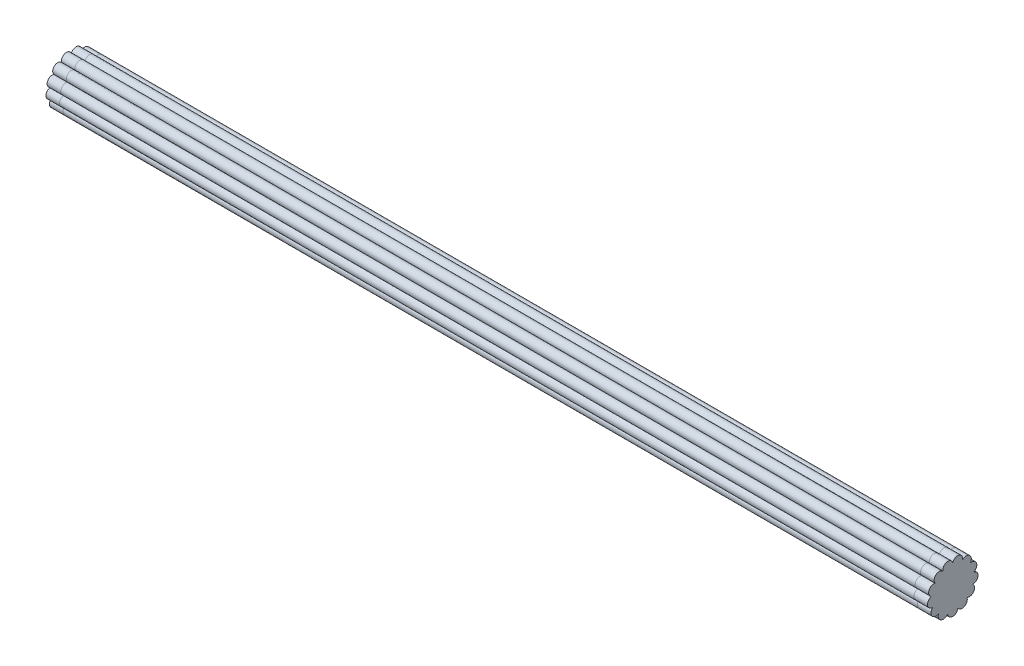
ISO-10303-21;
HEADER;
FILE_DESCRIPTION(('STEP AP214'),'2;1');
FILE_NAME('part.step','',(''),(''),'','','');
FILE_SCHEMA(('AUTOMOTIVE_DESIGN { 1 0 10303 214 1 1 1 1 }'));
ENDSEC;
DATA;
#1=APPLICATION_CONTEXT('core data for automotive mechanical design processes');
#2=APPLICATION_PROTOCOL_DEFINITION('international standard','automotive_design',2000,#1);
#3=PRODUCT_CONTEXT('',#1,'mechanical');
#4=PRODUCT('Part','Part','',(#3));
#5=PRODUCT_RELATED_PRODUCT_CATEGORY('part','',(#4));
#6=PRODUCT_DEFINITION_FORMATION('','',#4);
#7=PRODUCT_DEFINITION_CONTEXT('part definition',#1,'design');
#8=PRODUCT_DEFINITION('design','',#6,#7);
#9=PRODUCT_DEFINITION_SHAPE('','',#8);
#10=(LENGTH_UNIT() NAMED_UNIT(*) SI_UNIT(.MILLI.,.METRE.));
#11=(NAMED_UNIT(*) PLANE_ANGLE_UNIT() SI_UNIT($,.RADIAN.));
#12=(NAMED_UNIT(*) SI_UNIT($,.STERADIAN.) SOLID_ANGLE_UNIT());
#13=UNCERTAINTY_MEASURE_WITH_UNIT(LENGTH_MEASURE(1.E-05),#10,'distance_accuracy_value','');
#14=(GEOMETRIC_REPRESENTATION_CONTEXT(3) GLOBAL_UNCERTAINTY_ASSIGNED_CONTEXT((#13)) GLOBAL_UNIT_ASSIGNED_CONTEXT((#10,
#11,#12)) REPRESENTATION_CONTEXT('',''));
#15=CARTESIAN_POINT('',(0.,0.,0.));
#16=DIRECTION('',(0.,0.,1.));
#17=DIRECTION('',(1.,0.,0.));
#18=AXIS2_PLACEMENT_3D('',#15,#16,#17);
#19=CARTESIAN_POINT('',(650.,-26.5636807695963,13.9416951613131));
#20=DIRECTION('',(-1.,0.,0.));
#21=DIRECTION('',(0.,0.,-1.));
#22=AXIS2_PLACEMENT_3D('',#19,#20,#21);
#23=CYLINDRICAL_SURFACE('',#22,7.50000000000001);
#24=CARTESIAN_POINT('',(630.,-26.5636807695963,13.9416951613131));
#25=DIRECTION('',(-1.,0.,0.));
#26=DIRECTION('',(0.,0.,1.));
#27=AXIS2_PLACEMENT_3D('',#24,#25,#26);
#28=CIRCLE('',#27,7.50000000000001);
#29=CARTESIAN_POINT('',(630.,-30.3879587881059,7.48995914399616));
#30=VERTEX_POINT('',#29);
#31=CARTESIAN_POINT('',(630.,-23.4264436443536,20.7540180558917));
#32=VERTEX_POINT('',#31);
#33=EDGE_CURVE('E169',#30,#32,#28,.T.);
#34=ORIENTED_EDGE('',*,*,#33,.F.);
#35=DIRECTION('',(-1.,0.,0.));
#36=VECTOR('',#35,1.);
#37=CARTESIAN_POINT('',(650.,-30.3879587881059,7.48995914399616));
#38=LINE('',#37,#36);
#39=CARTESIAN_POINT('',(650.,-30.3879587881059,7.48995914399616));
#40=VERTEX_POINT('',#39);
#41=EDGE_CURVE('E168',#40,#30,#38,.T.);
#42=ORIENTED_EDGE('',*,*,#41,.F.);
#43=CARTESIAN_POINT('',(650.,-26.5636807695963,13.9416951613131));
#44=DIRECTION('',(-1.,0.,0.));
#45=DIRECTION('',(0.,0.,1.));
#46=AXIS2_PLACEMENT_3D('',#43,#44,#45);
#47=CIRCLE('',#46,7.50000000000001);
#48=CARTESIAN_POINT('',(650.,-23.4264436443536,20.7540180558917));
#49=VERTEX_POINT('',#48);
#50=EDGE_CURVE('E202',#40,#49,#47,.T.);
#51=ORIENTED_EDGE('',*,*,#50,.T.);
#52=DIRECTION('',(-1.,0.,0.));
#53=VECTOR('',#52,1.);
#54=CARTESIAN_POINT('',(650.,-23.4264436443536,20.7540180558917));
#55=LINE('',#54,#53);
#56=EDGE_CURVE('E12',#49,#32,#55,.T.);
#57=ORIENTED_EDGE('',*,*,#56,.T.);
#58=EDGE_LOOP('',(#34,#42,#51,#57));
#59=FACE_BOUND('',#58,.T.);
#60=ADVANCED_FACE('F43',(#59),#23,.T.);
#61=CARTESIAN_POINT('',(650.,-17.0419424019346,24.6895159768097));
#62=DIRECTION('',(-1.,0.,0.));
#63=DIRECTION('',(0.,0.,-1.));
#64=AXIS2_PLACEMENT_3D('',#61,#62,#63);
#65=CYLINDRICAL_SURFACE('',#64,7.50000000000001);
#66=CARTESIAN_POINT('',(630.,-17.0419424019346,24.6895159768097));
#67=DIRECTION('',(-1.,0.,0.));
#68=DIRECTION('',(0.,0.,1.));
#69=AXIS2_PLACEMENT_3D('',#66,#67,#68);
#70=CIRCLE('',#69,7.50000000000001);
#71=CARTESIAN_POINT('',(630.,-11.0982125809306,29.2635815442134));
#72=VERTEX_POINT('',#71);
#73=EDGE_CURVE('E171',#32,#72,#70,.T.);
#74=ORIENTED_EDGE('',*,*,#73,.F.);
#75=ORIENTED_EDGE('',*,*,#56,.F.);
#76=CARTESIAN_POINT('',(650.,-17.0419424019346,24.6895159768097));
#77=DIRECTION('',(-1.,0.,0.));
#78=DIRECTION('',(0.,0.,1.));
#79=AXIS2_PLACEMENT_3D('',#76,#77,#78);
#80=CIRCLE('',#79,7.50000000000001);
#81=CARTESIAN_POINT('',(650.,-11.0982125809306,29.2635815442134));
#82=VERTEX_POINT('',#81);
#83=EDGE_CURVE('E112',#49,#82,#80,.T.);
#84=ORIENTED_EDGE('',*,*,#83,.T.);
#85=DIRECTION('',(-1.,0.,0.));
#86=VECTOR('',#85,1.);
#87=CARTESIAN_POINT('',(650.,-11.0982125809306,29.2635815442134));
#88=LINE('',#87,#86);
#89=EDGE_CURVE('E51',#82,#72,#88,.T.);
#90=ORIENTED_EDGE('',*,*,#89,.T.);
#91=EDGE_LOOP('',(#74,#75,#84,#90));
#92=FACE_BOUND('',#91,.T.);
#93=ADVANCED_FACE('F229',(#92),#65,.T.);
#94=CARTESIAN_POINT('',(650.,-3.61610040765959,29.7812662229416));
#95=DIRECTION('',(-1.,0.,0.));
#96=DIRECTION('',(0.,0.,-1.));
#97=AXIS2_PLACEMENT_3D('',#94,#95,#96);
#98=CYLINDRICAL_SURFACE('',#97,7.50000000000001);
#99=CARTESIAN_POINT('',(630.,-3.61610040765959,29.7812662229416));
#100=DIRECTION('',(-1.,0.,0.));
#101=DIRECTION('',(0.,0.,1.));
#102=AXIS2_PLACEMENT_3D('',#99,#100,#101);
#103=CIRCLE('',#102,7.50000000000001);
#104=CARTESIAN_POINT('',(630.,3.77248523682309,31.0692111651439));
#105=VERTEX_POINT('',#104);
#106=EDGE_CURVE('E174',#72,#105,#103,.T.);
#107=ORIENTED_EDGE('',*,*,#106,.F.);
#108=ORIENTED_EDGE('',*,*,#89,.F.);
#109=CARTESIAN_POINT('',(650.,-3.61610040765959,29.7812662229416));
#110=DIRECTION('',(-1.,0.,0.));
#111=DIRECTION('',(0.,0.,1.));
#112=AXIS2_PLACEMENT_3D('',#109,#110,#111);
#113=CIRCLE('',#112,7.50000000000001);
#114=CARTESIAN_POINT('',(650.,3.77248523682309,31.0692111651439));
#115=VERTEX_POINT('',#114);
#116=EDGE_CURVE('E238',#82,#115,#113,.T.);
#117=ORIENTED_EDGE('',*,*,#116,.T.);
#118=DIRECTION('',(-1.,0.,0.));
#119=VECTOR('',#118,1.);
#120=CARTESIAN_POINT('',(650.,3.77248523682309,31.0692111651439));
#121=LINE('',#120,#119);
#122=EDGE_CURVE('E224',#115,#105,#121,.T.);
#123=ORIENTED_EDGE('',*,*,#122,.T.);
#124=EDGE_LOOP('',(#107,#108,#117,#123));
#125=FACE_BOUND('',#124,.T.);
#126=ADVANCED_FACE('F278',(#125),#98,.T.);
#127=CARTESIAN_POINT('',(650.,10.6381466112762,28.0504872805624));
#128=DIRECTION('',(-1.,0.,0.));
#129=DIRECTION('',(0.,0.,-1.));
#130=AXIS2_PLACEMENT_3D('',#127,#128,#129);
#131=CYLINDRICAL_SURFACE('',#130,7.50000000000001);
#132=CARTESIAN_POINT('',(630.,10.6381466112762,28.0504872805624));
#133=DIRECTION('',(-1.,0.,0.));
#134=DIRECTION('',(0.,0.,1.));
#135=AXIS2_PLACEMENT_3D('',#132,#133,#134);
#136=CIRCLE('',#135,7.50000000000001);
#137=CARTESIAN_POINT('',(630.,17.7789521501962,25.7572589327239));
#138=VERTEX_POINT('',#137);
#139=EDGE_CURVE('E177',#105,#138,#136,.T.);
#140=ORIENTED_EDGE('',*,*,#139,.F.);
#141=ORIENTED_EDGE('',*,*,#122,.F.);
#142=CARTESIAN_POINT('',(650.,10.6381466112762,28.0504872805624));
#143=DIRECTION('',(-1.,0.,0.));
#144=DIRECTION('',(0.,0.,1.));
#145=AXIS2_PLACEMENT_3D('',#142,#143,#144);
#146=CIRCLE('',#145,7.50000000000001);
#147=CARTESIAN_POINT('',(650.,17.7789521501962,25.7572589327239));
#148=VERTEX_POINT('',#147);
#149=EDGE_CURVE('E242',#115,#148,#146,.T.);
#150=ORIENTED_EDGE('',*,*,#149,.T.);
#151=DIRECTION('',(-1.,0.,0.));
#152=VECTOR('',#151,1.);
#153=CARTESIAN_POINT('',(650.,17.7789521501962,25.7572589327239));
#154=LINE('',#153,#152);
#155=EDGE_CURVE('E221',#148,#138,#154,.T.);
#156=ORIENTED_EDGE('',*,*,#155,.T.);
#157=EDGE_LOOP('',(#140,#141,#150,#156));
#158=FACE_BOUND('',#157,.T.);
#159=ADVANCED_FACE('F277',(#158),#131,.T.);
#160=CARTESIAN_POINT('',(650.,22.4553224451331,19.8936797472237));
#161=DIRECTION('',(-1.,0.,0.));
#162=DIRECTION('',(0.,0.,-1.));
#163=AXIS2_PLACEMENT_3D('',#160,#161,#162);
#164=CYLINDRICAL_SURFACE('',#163,7.50000000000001);
#165=CARTESIAN_POINT('',(630.,22.4553224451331,19.8936797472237));
#166=DIRECTION('',(-1.,0.,0.));
#167=DIRECTION('',(0.,0.,1.));
#168=AXIS2_PLACEMENT_3D('',#165,#166,#167);
#169=CIRCLE('',#168,7.50000000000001);
#170=CARTESIAN_POINT('',(630.,27.7124753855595,14.5446290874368));
#171=VERTEX_POINT('',#170);
#172=EDGE_CURVE('E180',#138,#171,#169,.T.);
#173=ORIENTED_EDGE('',*,*,#172,.F.);
#174=ORIENTED_EDGE('',*,*,#155,.F.);
#175=CARTESIAN_POINT('',(650.,22.4553224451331,19.8936797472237));
#176=DIRECTION('',(-1.,0.,0.));
#177=DIRECTION('',(0.,0.,1.));
#178=AXIS2_PLACEMENT_3D('',#175,#176,#177);
#179=CIRCLE('',#178,7.50000000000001);
#180=CARTESIAN_POINT('',(650.,27.7124753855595,14.5446290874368));
#181=VERTEX_POINT('',#180);
#182=EDGE_CURVE('E245',#148,#181,#179,.T.);
#183=ORIENTED_EDGE('',*,*,#182,.T.);
#184=DIRECTION('',(-1.,0.,0.));
#185=VECTOR('',#184,1.);
#186=CARTESIAN_POINT('',(650.,27.7124753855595,14.5446290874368));
#187=LINE('',#186,#185);
#188=EDGE_CURVE('E218',#181,#171,#187,.T.);
#189=ORIENTED_EDGE('',*,*,#188,.T.);
#190=EDGE_LOOP('',(#173,#174,#183,#189));
#191=FACE_BOUND('',#190,.T.);
#192=ADVANCED_FACE('F274',(#191),#164,.T.);
#193=CARTESIAN_POINT('',(650.,29.1282545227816,7.17946992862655));
#194=DIRECTION('',(-1.,0.,0.));
#195=DIRECTION('',(0.,0.,-1.));
#196=AXIS2_PLACEMENT_3D('',#193,#194,#195);
#197=CYLINDRICAL_SURFACE('',#196,7.5);
#198=CARTESIAN_POINT('',(630.,29.1282545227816,7.17946992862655));
#199=DIRECTION('',(-1.,0.,0.));
#200=DIRECTION('',(0.,0.,1.));
#201=AXIS2_PLACEMENT_3D('',#198,#199,#200);
#202=CIRCLE('',#201,7.5);
#203=CARTESIAN_POINT('',(630.,31.2974044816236,-2.15105711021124E-13));
#204=VERTEX_POINT('',#203);
#205=EDGE_CURVE('E183',#171,#204,#202,.T.);
#206=ORIENTED_EDGE('',*,*,#205,.F.);
#207=ORIENTED_EDGE('',*,*,#188,.F.);
#208=CARTESIAN_POINT('',(650.,29.1282545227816,7.17946992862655));
#209=DIRECTION('',(-1.,0.,0.));
#210=DIRECTION('',(0.,0.,1.));
#211=AXIS2_PLACEMENT_3D('',#208,#209,#210);
#212=CIRCLE('',#211,7.5);
#213=CARTESIAN_POINT('',(650.,31.2974044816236,-2.15105711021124E-13));
#214=VERTEX_POINT('',#213);
#215=EDGE_CURVE('E248',#181,#214,#212,.T.);
#216=ORIENTED_EDGE('',*,*,#215,.T.);
#217=DIRECTION('',(-1.,0.,0.));
#218=VECTOR('',#217,1.);
#219=CARTESIAN_POINT('',(650.,31.2974044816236,-2.15105711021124E-13));
#220=LINE('',#219,#218);
#221=EDGE_CURVE('E215',#214,#204,#220,.T.);
#222=ORIENTED_EDGE('',*,*,#221,.T.);
#223=EDGE_LOOP('',(#206,#207,#216,#222));
#224=FACE_BOUND('',#223,.T.);
#225=ADVANCED_FACE('F272',(#224),#197,.T.);
#226=CARTESIAN_POINT('',(650.,29.1282545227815,-7.17946992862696));
#227=DIRECTION('',(-1.,0.,0.));
#228=DIRECTION('',(0.,0.,-1.));
#229=AXIS2_PLACEMENT_3D('',#226,#227,#228);
#230=CYLINDRICAL_SURFACE('',#229,7.50000000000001);
#231=CARTESIAN_POINT('',(630.,29.1282545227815,-7.17946992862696));
#232=DIRECTION('',(-1.,0.,0.));
#233=DIRECTION('',(0.,0.,1.));
#234=AXIS2_PLACEMENT_3D('',#231,#232,#233);
#235=CIRCLE('',#234,7.50000000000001);
#236=CARTESIAN_POINT('',(630.,27.7124753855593,-14.5446290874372));
#237=VERTEX_POINT('',#236);
#238=EDGE_CURVE('E186',#204,#237,#235,.T.);
#239=ORIENTED_EDGE('',*,*,#238,.F.);
#240=ORIENTED_EDGE('',*,*,#221,.F.);
#241=CARTESIAN_POINT('',(650.,29.1282545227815,-7.17946992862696));
#242=DIRECTION('',(-1.,0.,0.));
#243=DIRECTION('',(0.,0.,1.));
#244=AXIS2_PLACEMENT_3D('',#241,#242,#243);
#245=CIRCLE('',#244,7.50000000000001);
#246=CARTESIAN_POINT('',(650.,27.7124753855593,-14.5446290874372));
#247=VERTEX_POINT('',#246);
#248=EDGE_CURVE('E251',#214,#247,#245,.T.);
#249=ORIENTED_EDGE('',*,*,#248,.T.);
#250=DIRECTION('',(-1.,0.,0.));
#251=VECTOR('',#250,1.);
#252=CARTESIAN_POINT('',(650.,27.7124753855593,-14.5446290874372));
#253=LINE('',#252,#251);
#254=EDGE_CURVE('E212',#247,#237,#253,.T.);
#255=ORIENTED_EDGE('',*,*,#254,.T.);
#256=EDGE_LOOP('',(#239,#240,#249,#255));
#257=FACE_BOUND('',#256,.T.);
#258=ADVANCED_FACE('F268',(#257),#230,.T.);
#259=CARTESIAN_POINT('',(650.,22.4553224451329,-19.893679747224));
#260=DIRECTION('',(-1.,0.,0.));
#261=DIRECTION('',(0.,0.,-1.));
#262=AXIS2_PLACEMENT_3D('',#259,#260,#261);
#263=CYLINDRICAL_SURFACE('',#262,7.50000000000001);
#264=CARTESIAN_POINT('',(630.,22.4553224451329,-19.893679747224));
#265=DIRECTION('',(-1.,0.,0.));
#266=DIRECTION('',(0.,0.,1.));
#267=AXIS2_PLACEMENT_3D('',#264,#265,#266);
#268=CIRCLE('',#267,7.50000000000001);
#269=CARTESIAN_POINT('',(630.,17.7789521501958,-25.7572589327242));
#270=VERTEX_POINT('',#269);
#271=EDGE_CURVE('E189',#237,#270,#268,.T.);
#272=ORIENTED_EDGE('',*,*,#271,.F.);
#273=ORIENTED_EDGE('',*,*,#254,.F.);
#274=CARTESIAN_POINT('',(650.,22.4553224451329,-19.893679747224));
#275=DIRECTION('',(-1.,0.,0.));
#276=DIRECTION('',(0.,0.,1.));
#277=AXIS2_PLACEMENT_3D('',#274,#275,#276);
#278=CIRCLE('',#277,7.50000000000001);
#279=CARTESIAN_POINT('',(650.,17.7789521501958,-25.7572589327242));
#280=VERTEX_POINT('',#279);
#281=EDGE_CURVE('E254',#247,#280,#278,.T.);
#282=ORIENTED_EDGE('',*,*,#281,.T.);
#283=DIRECTION('',(-1.,0.,0.));
#284=VECTOR('',#283,1.);
#285=CARTESIAN_POINT('',(650.,17.7789521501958,-25.7572589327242));
#286=LINE('',#285,#284);
#287=EDGE_CURVE('E209',#280,#270,#286,.T.);
#288=ORIENTED_EDGE('',*,*,#287,.T.);
#289=EDGE_LOOP('',(#272,#273,#282,#288));
#290=FACE_BOUND('',#289,.T.);
#291=ADVANCED_FACE('F265',(#290),#263,.T.);
#292=CARTESIAN_POINT('',(650.,10.6381466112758,-28.0504872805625));
#293=DIRECTION('',(-1.,0.,0.));
#294=DIRECTION('',(0.,0.,-1.));
#295=AXIS2_PLACEMENT_3D('',#292,#293,#294);
#296=CYLINDRICAL_SURFACE('',#295,7.49999999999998);
#297=CARTESIAN_POINT('',(630.,10.6381466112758,-28.0504872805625));
#298=DIRECTION('',(-1.,0.,0.));
#299=DIRECTION('',(0.,0.,1.));
#300=AXIS2_PLACEMENT_3D('',#297,#298,#299);
#301=CIRCLE('',#300,7.49999999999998);
#302=CARTESIAN_POINT('',(630.,3.77248523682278,-31.069211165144));
#303=VERTEX_POINT('',#302);
#304=EDGE_CURVE('E192',#270,#303,#301,.T.);
#305=ORIENTED_EDGE('',*,*,#304,.F.);
#306=ORIENTED_EDGE('',*,*,#287,.F.);
#307=CARTESIAN_POINT('',(650.,10.6381466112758,-28.0504872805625));
#308=DIRECTION('',(-1.,0.,0.));
#309=DIRECTION('',(0.,0.,1.));
#310=AXIS2_PLACEMENT_3D('',#307,#308,#309);
#311=CIRCLE('',#310,7.49999999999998);
#312=CARTESIAN_POINT('',(650.,3.77248523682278,-31.069211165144));
#313=VERTEX_POINT('',#312);
#314=EDGE_CURVE('E163',#280,#313,#311,.T.);
#315=ORIENTED_EDGE('',*,*,#314,.T.);
#316=DIRECTION('',(-1.,0.,0.));
#317=VECTOR('',#316,1.);
#318=CARTESIAN_POINT('',(650.,3.77248523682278,-31.069211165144));
#319=LINE('',#318,#317);
#320=EDGE_CURVE('E206',#313,#303,#319,.T.);
#321=ORIENTED_EDGE('',*,*,#320,.T.);
#322=EDGE_LOOP('',(#305,#306,#315,#321));
#323=FACE_BOUND('',#322,.T.);
#324=ADVANCED_FACE('F259',(#323),#296,.T.);
#325=CARTESIAN_POINT('',(650.,-3.61610040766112,-29.7812662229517));
#326=DIRECTION('',(-1.,0.,0.));
#327=DIRECTION('',(0.,0.,-1.));
#328=AXIS2_PLACEMENT_3D('',#325,#326,#327);
#329=CYLINDRICAL_SURFACE('',#328,7.49999999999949);
#330=CARTESIAN_POINT('',(630.,-3.61610040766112,-29.7812662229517));
#331=DIRECTION('',(-1.,0.,0.));
#332=DIRECTION('',(0.,0.,1.));
#333=AXIS2_PLACEMENT_3D('',#330,#331,#332);
#334=CIRCLE('',#333,7.49999999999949);
#335=CARTESIAN_POINT('',(630.,-11.098212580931,-29.2635815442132));
#336=VERTEX_POINT('',#335);
#337=EDGE_CURVE('E195',#303,#336,#334,.T.);
#338=ORIENTED_EDGE('',*,*,#337,.F.);
#339=ORIENTED_EDGE('',*,*,#320,.F.);
#340=CARTESIAN_POINT('',(650.,-3.61610040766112,-29.7812662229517));
#341=DIRECTION('',(-1.,0.,0.));
#342=DIRECTION('',(0.,0.,1.));
#343=AXIS2_PLACEMENT_3D('',#340,#341,#342);
#344=CIRCLE('',#343,7.49999999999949);
#345=CARTESIAN_POINT('',(650.,-11.098212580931,-29.2635815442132));
#346=VERTEX_POINT('',#345);
#347=EDGE_CURVE('E161',#313,#346,#344,.T.);
#348=ORIENTED_EDGE('',*,*,#347,.T.);
#349=DIRECTION('',(-1.,0.,0.));
#350=VECTOR('',#349,1.);
#351=CARTESIAN_POINT('',(650.,-11.098212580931,-29.2635815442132));
#352=LINE('',#351,#350);
#353=EDGE_CURVE('E155',#346,#336,#352,.T.);
#354=ORIENTED_EDGE('',*,*,#353,.T.);
#355=EDGE_LOOP('',(#338,#339,#348,#354));
#356=FACE_BOUND('',#355,.T.);
#357=ADVANCED_FACE('F263',(#356),#329,.T.);
#358=CARTESIAN_POINT('',(650.,-17.041942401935,-24.6895159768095));
#359=DIRECTION('',(-1.,0.,0.));
#360=DIRECTION('',(0.,0.,-1.));
#361=AXIS2_PLACEMENT_3D('',#358,#359,#360);
#362=CYLINDRICAL_SURFACE('',#361,7.50000000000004);
#363=CARTESIAN_POINT('',(630.,-17.041942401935,-24.6895159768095));
#364=DIRECTION('',(-1.,0.,0.));
#365=DIRECTION('',(0.,0.,1.));
#366=AXIS2_PLACEMENT_3D('',#363,#364,#365);
#367=CIRCLE('',#366,7.50000000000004);
#368=CARTESIAN_POINT('',(630.,-23.4264436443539,-20.7540180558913));
#369=VERTEX_POINT('',#368);
#370=EDGE_CURVE('E198',#336,#369,#367,.T.);
#371=ORIENTED_EDGE('',*,*,#370,.F.);
#372=ORIENTED_EDGE('',*,*,#353,.F.);
#373=CARTESIAN_POINT('',(650.,-17.041942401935,-24.6895159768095));
#374=DIRECTION('',(-1.,0.,0.));
#375=DIRECTION('',(0.,0.,1.));
#376=AXIS2_PLACEMENT_3D('',#373,#374,#375);
#377=CIRCLE('',#376,7.50000000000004);
#378=CARTESIAN_POINT('',(650.,-23.4264436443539,-20.7540180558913));
#379=VERTEX_POINT('',#378);
#380=EDGE_CURVE('E145',#346,#379,#377,.T.);
#381=ORIENTED_EDGE('',*,*,#380,.T.);
#382=DIRECTION('',(-1.,0.,0.));
#383=VECTOR('',#382,1.);
#384=CARTESIAN_POINT('',(650.,-23.4264436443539,-20.7540180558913));
#385=LINE('',#384,#383);
#386=EDGE_CURVE('E150',#379,#369,#385,.T.);
#387=ORIENTED_EDGE('',*,*,#386,.T.);
#388=EDGE_LOOP('',(#371,#372,#381,#387));
#389=FACE_BOUND('',#388,.T.);
#390=ADVANCED_FACE('F158',(#389),#362,.T.);
#391=CARTESIAN_POINT('',(650.,-26.5636807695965,-13.9416951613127));
#392=DIRECTION('',(-1.,0.,0.));
#393=DIRECTION('',(0.,0.,-1.));
#394=AXIS2_PLACEMENT_3D('',#391,#392,#393);
#395=CYLINDRICAL_SURFACE('',#394,7.50000000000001);
#396=CARTESIAN_POINT('',(630.,-26.5636807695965,-13.9416951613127));
#397=DIRECTION('',(-1.,0.,0.));
#398=DIRECTION('',(0.,0.,1.));
#399=AXIS2_PLACEMENT_3D('',#396,#397,#398);
#400=CIRCLE('',#399,7.50000000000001);
#401=CARTESIAN_POINT('',(630.,-30.3879587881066,-7.48995914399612));
#402=VERTEX_POINT('',#401);
#403=EDGE_CURVE('E152',#369,#402,#400,.T.);
#404=ORIENTED_EDGE('',*,*,#403,.F.);
#405=ORIENTED_EDGE('',*,*,#386,.F.);
#406=CARTESIAN_POINT('',(650.,-26.5636807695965,-13.9416951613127));
#407=DIRECTION('',(-1.,0.,0.));
#408=DIRECTION('',(0.,0.,1.));
#409=AXIS2_PLACEMENT_3D('',#406,#407,#408);
#410=CIRCLE('',#409,7.50000000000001);
#411=CARTESIAN_POINT('',(650.,-30.3879587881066,-7.48995914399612));
#412=VERTEX_POINT('',#411);
#413=EDGE_CURVE('E141',#379,#412,#410,.T.);
#414=ORIENTED_EDGE('',*,*,#413,.T.);
#415=DIRECTION('',(-1.,0.,0.));
#416=VECTOR('',#415,1.);
#417=CARTESIAN_POINT('',(650.,-30.3879587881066,-7.48995914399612));
#418=LINE('',#417,#416);
#419=EDGE_CURVE('E156',#412,#402,#418,.T.);
#420=ORIENTED_EDGE('',*,*,#419,.T.);
#421=EDGE_LOOP('',(#404,#405,#414,#420));
#422=FACE_BOUND('',#421,.T.);
#423=ADVANCED_FACE('F151',(#422),#395,.T.);
#424=CARTESIAN_POINT('',(650.,-30.,0.));
#425=DIRECTION('',(-1.,0.,0.));
#426=DIRECTION('',(0.,0.,-1.));
#427=AXIS2_PLACEMENT_3D('',#424,#425,#426);
#428=CYLINDRICAL_SURFACE('',#427,7.50000000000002);
#429=CARTESIAN_POINT('',(630.,-30.,0.));
#430=DIRECTION('',(-1.,0.,0.));
#431=DIRECTION('',(0.,0.,1.));
#432=AXIS2_PLACEMENT_3D('',#429,#430,#431);
#433=CIRCLE('',#432,7.50000000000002);
#434=EDGE_CURVE('E100',#402,#30,#433,.T.);
#435=ORIENTED_EDGE('',*,*,#434,.F.);
#436=ORIENTED_EDGE('',*,*,#419,.F.);
#437=CARTESIAN_POINT('',(650.,-30.,0.));
#438=DIRECTION('',(-1.,0.,0.));
#439=DIRECTION('',(0.,0.,1.));
#440=AXIS2_PLACEMENT_3D('',#437,#438,#439);
#441=CIRCLE('',#440,7.50000000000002);
#442=EDGE_CURVE('E59',#412,#40,#441,.T.);
#443=ORIENTED_EDGE('',*,*,#442,.T.);
#444=ORIENTED_EDGE('',*,*,#41,.T.);
#445=EDGE_LOOP('',(#435,#436,#443,#444));
#446=FACE_BOUND('',#445,.T.);
#447=ADVANCED_FACE('F368',(#446),#428,.T.);
#448=CARTESIAN_POINT('',(650.,-21.8028115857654,19.3156055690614));
#449=DIRECTION('',(1.,0.,0.));
#450=DIRECTION('',(0.,0.,1.));
#451=AXIS2_PLACEMENT_3D('',#448,#449,#450);
#452=PLANE('',#451);
#453=ORIENTED_EDGE('',*,*,#50,.F.);
#454=ORIENTED_EDGE('',*,*,#442,.F.);
#455=ORIENTED_EDGE('',*,*,#413,.F.);
#456=ORIENTED_EDGE('',*,*,#380,.F.);
#457=ORIENTED_EDGE('',*,*,#347,.F.);
#458=ORIENTED_EDGE('',*,*,#314,.F.);
#459=ORIENTED_EDGE('',*,*,#281,.F.);
#460=ORIENTED_EDGE('',*,*,#248,.F.);
#461=ORIENTED_EDGE('',*,*,#215,.F.);
#462=ORIENTED_EDGE('',*,*,#182,.F.);
#463=ORIENTED_EDGE('',*,*,#149,.F.);
#464=ORIENTED_EDGE('',*,*,#116,.F.);
#465=ORIENTED_EDGE('',*,*,#83,.F.);
#466=EDGE_LOOP('',(#453,#454,#455,#456,#457,#458,#459,#460,#461,#462,#463,#464,#465));
#467=FACE_BOUND('',#466,.T.);
#468=ADVANCED_FACE('F143',(#467),#452,.T.);
#469=CARTESIAN_POINT('',(630.,-21.8028115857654,19.3156055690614));
#470=DIRECTION('',(1.,0.,0.));
#471=DIRECTION('',(0.,0.,1.));
#472=AXIS2_PLACEMENT_3D('',#469,#470,#471);
#473=PLANE('',#472);
#474=ORIENTED_EDGE('',*,*,#33,.T.);
#475=ORIENTED_EDGE('',*,*,#73,.T.);
#476=ORIENTED_EDGE('',*,*,#106,.T.);
#477=ORIENTED_EDGE('',*,*,#139,.T.);
#478=ORIENTED_EDGE('',*,*,#172,.T.);
#479=ORIENTED_EDGE('',*,*,#205,.T.);
#480=ORIENTED_EDGE('',*,*,#238,.T.);
#481=ORIENTED_EDGE('',*,*,#271,.T.);
#482=ORIENTED_EDGE('',*,*,#304,.T.);
#483=ORIENTED_EDGE('',*,*,#337,.T.);
#484=ORIENTED_EDGE('',*,*,#370,.T.);
#485=ORIENTED_EDGE('',*,*,#403,.T.);
#486=ORIENTED_EDGE('',*,*,#434,.T.);
#487=EDGE_LOOP('',(#474,#475,#476,#477,#478,#479,#480,#481,#482,#483,#484,#485,#486));
#488=FACE_BOUND('',#487,.T.);
#489=ADVANCED_FACE('F232',(#488),#473,.F.);
#490=CLOSED_SHELL('',(#60,#93,#126,#159,#192,#225,#258,#291,#324,#357,#390,#423,#447,#468,#489));
#491=MANIFOLD_SOLID_BREP('B2',#490);
#492=CARTESIAN_POINT('',(-650.,-26.5636807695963,13.9416951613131));
#493=DIRECTION('',(1.,0.,0.));
#494=DIRECTION('',(0.,0.,-1.));
#495=AXIS2_PLACEMENT_3D('',#492,#493,#494);
#496=CYLINDRICAL_SURFACE('',#495,7.50000000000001);
#497=CARTESIAN_POINT('',(-630.,-26.5636807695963,13.9416951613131));
#498=DIRECTION('',(-1.,0.,0.));
#499=DIRECTION('',(0.,0.,1.));
#500=AXIS2_PLACEMENT_3D('',#497,#498,#499);
#501=CIRCLE('',#500,7.50000000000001);
#502=CARTESIAN_POINT('',(-630.,-30.3879587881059,7.48995914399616));
#503=VERTEX_POINT('',#502);
#504=CARTESIAN_POINT('',(-630.,-23.4264436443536,20.7540180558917));
#505=VERTEX_POINT('',#504);
#506=EDGE_CURVE('E534',#503,#505,#501,.T.);
#507=ORIENTED_EDGE('',*,*,#506,.T.);
#508=DIRECTION('',(1.,0.,0.));
#509=VECTOR('',#508,1.);
#510=CARTESIAN_POINT('',(-650.,-23.4264436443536,20.7540180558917));
#511=LINE('',#510,#509);
#512=CARTESIAN_POINT('',(-650.,-23.4264436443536,20.7540180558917));
#513=VERTEX_POINT('',#512);
#514=EDGE_CURVE('E41',#513,#505,#511,.T.);
#515=ORIENTED_EDGE('',*,*,#514,.F.);
#516=CARTESIAN_POINT('',(-650.,-26.5636807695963,13.9416951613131));
#517=DIRECTION('',(-1.,0.,0.));
#518=DIRECTION('',(0.,0.,1.));
#519=AXIS2_PLACEMENT_3D('',#516,#517,#518);
#520=CIRCLE('',#519,7.50000000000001);
#521=CARTESIAN_POINT('',(-650.,-30.3879587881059,7.48995914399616));
#522=VERTEX_POINT('',#521);
#523=EDGE_CURVE('E558',#522,#513,#520,.T.);
#524=ORIENTED_EDGE('',*,*,#523,.F.);
#525=DIRECTION('',(1.,0.,0.));
#526=VECTOR('',#525,1.);
#527=CARTESIAN_POINT('',(-650.,-30.3879587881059,7.48995914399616));
#528=LINE('',#527,#526);
#529=EDGE_CURVE('E530',#522,#503,#528,.T.);
#530=ORIENTED_EDGE('',*,*,#529,.T.);
#531=EDGE_LOOP('',(#507,#515,#524,#530));
#532=FACE_BOUND('',#531,.T.);
#533=ADVANCED_FACE('F408',(#532),#496,.T.);
#534=CARTESIAN_POINT('',(-650.,-17.0419424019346,24.6895159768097));
#535=DIRECTION('',(1.,0.,0.));
#536=DIRECTION('',(0.,0.,-1.));
#537=AXIS2_PLACEMENT_3D('',#534,#535,#536);
#538=CYLINDRICAL_SURFACE('',#537,7.50000000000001);
#539=CARTESIAN_POINT('',(-630.,-17.0419424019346,24.6895159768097));
#540=DIRECTION('',(-1.,0.,0.));
#541=DIRECTION('',(0.,0.,1.));
#542=AXIS2_PLACEMENT_3D('',#539,#540,#541);
#543=CIRCLE('',#542,7.50000000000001);
#544=CARTESIAN_POINT('',(-630.,-11.0982125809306,29.2635815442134));
#545=VERTEX_POINT('',#544);
#546=EDGE_CURVE('E537',#505,#545,#543,.T.);
#547=ORIENTED_EDGE('',*,*,#546,.T.);
#548=DIRECTION('',(1.,0.,0.));
#549=VECTOR('',#548,1.);
#550=CARTESIAN_POINT('',(-650.,-11.0982125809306,29.2635815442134));
#551=LINE('',#550,#549);
#552=CARTESIAN_POINT('',(-650.,-11.0982125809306,29.2635815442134));
#553=VERTEX_POINT('',#552);
#554=EDGE_CURVE('E416',#553,#545,#551,.T.);
#555=ORIENTED_EDGE('',*,*,#554,.F.);
#556=CARTESIAN_POINT('',(-650.,-17.0419424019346,24.6895159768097));
#557=DIRECTION('',(-1.,0.,0.));
#558=DIRECTION('',(0.,0.,1.));
#559=AXIS2_PLACEMENT_3D('',#556,#557,#558);
#560=CIRCLE('',#559,7.50000000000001);
#561=EDGE_CURVE('E482',#513,#553,#560,.T.);
#562=ORIENTED_EDGE('',*,*,#561,.F.);
#563=ORIENTED_EDGE('',*,*,#514,.T.);
#564=EDGE_LOOP('',(#547,#555,#562,#563));
#565=FACE_BOUND('',#564,.T.);
#566=ADVANCED_FACE('F641',(#565),#538,.T.);
#567=CARTESIAN_POINT('',(-650.,-3.61610040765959,29.7812662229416));
#568=DIRECTION('',(1.,0.,0.));
#569=DIRECTION('',(0.,0.,-1.));
#570=AXIS2_PLACEMENT_3D('',#567,#568,#569);
#571=CYLINDRICAL_SURFACE('',#570,7.50000000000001);
#572=CARTESIAN_POINT('',(-630.,-3.61610040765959,29.7812662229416));
#573=DIRECTION('',(-1.,0.,0.));
#574=DIRECTION('',(0.,0.,1.));
#575=AXIS2_PLACEMENT_3D('',#572,#573,#574);
#576=CIRCLE('',#575,7.50000000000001);
#577=CARTESIAN_POINT('',(-630.,3.77248523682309,31.0692111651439));
#578=VERTEX_POINT('',#577);
#579=EDGE_CURVE('E539',#545,#578,#576,.T.);
#580=ORIENTED_EDGE('',*,*,#579,.T.);
#581=DIRECTION('',(1.,0.,0.));
#582=VECTOR('',#581,1.);
#583=CARTESIAN_POINT('',(-650.,3.77248523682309,31.0692111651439));
#584=LINE('',#583,#582);
#585=CARTESIAN_POINT('',(-650.,3.77248523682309,31.0692111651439));
#586=VERTEX_POINT('',#585);
#587=EDGE_CURVE('E580',#586,#578,#584,.T.);
#588=ORIENTED_EDGE('',*,*,#587,.F.);
#589=CARTESIAN_POINT('',(-650.,-3.61610040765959,29.7812662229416));
#590=DIRECTION('',(-1.,0.,0.));
#591=DIRECTION('',(0.,0.,1.));
#592=AXIS2_PLACEMENT_3D('',#589,#590,#591);
#593=CIRCLE('',#592,7.50000000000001);
#594=EDGE_CURVE('E588',#553,#586,#593,.T.);
#595=ORIENTED_EDGE('',*,*,#594,.F.);
#596=ORIENTED_EDGE('',*,*,#554,.T.);
#597=EDGE_LOOP('',(#580,#588,#595,#596));
#598=FACE_BOUND('',#597,.T.);
#599=ADVANCED_FACE('F586',(#598),#571,.T.);
#600=CARTESIAN_POINT('',(-650.,10.6381466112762,28.0504872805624));
#601=DIRECTION('',(1.,0.,0.));
#602=DIRECTION('',(0.,0.,-1.));
#603=AXIS2_PLACEMENT_3D('',#600,#601,#602);
#604=CYLINDRICAL_SURFACE('',#603,7.50000000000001);
#605=CARTESIAN_POINT('',(-630.,10.6381466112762,28.0504872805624));
#606=DIRECTION('',(-1.,0.,0.));
#607=DIRECTION('',(0.,0.,1.));
#608=AXIS2_PLACEMENT_3D('',#605,#606,#607);
#609=CIRCLE('',#608,7.50000000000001);
#610=CARTESIAN_POINT('',(-630.,17.7789521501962,25.7572589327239));
#611=VERTEX_POINT('',#610);
#612=EDGE_CURVE('E541',#578,#611,#609,.T.);
#613=ORIENTED_EDGE('',*,*,#612,.T.);
#614=DIRECTION('',(1.,0.,0.));
#615=VECTOR('',#614,1.);
#616=CARTESIAN_POINT('',(-650.,17.7789521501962,25.7572589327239));
#617=LINE('',#616,#615);
#618=CARTESIAN_POINT('',(-650.,17.7789521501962,25.7572589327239));
#619=VERTEX_POINT('',#618);
#620=EDGE_CURVE('E577',#619,#611,#617,.T.);
#621=ORIENTED_EDGE('',*,*,#620,.F.);
#622=CARTESIAN_POINT('',(-650.,10.6381466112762,28.0504872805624));
#623=DIRECTION('',(-1.,0.,0.));
#624=DIRECTION('',(0.,0.,1.));
#625=AXIS2_PLACEMENT_3D('',#622,#623,#624);
#626=CIRCLE('',#625,7.50000000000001);
#627=EDGE_CURVE('E606',#586,#619,#626,.T.);
#628=ORIENTED_EDGE('',*,*,#627,.F.);
#629=ORIENTED_EDGE('',*,*,#587,.T.);
#630=EDGE_LOOP('',(#613,#621,#628,#629));
#631=FACE_BOUND('',#630,.T.);
#632=ADVANCED_FACE('F597',(#631),#604,.T.);
#633=CARTESIAN_POINT('',(-650.,22.4553224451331,19.8936797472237));
#634=DIRECTION('',(1.,0.,0.));
#635=DIRECTION('',(0.,0.,-1.));
#636=AXIS2_PLACEMENT_3D('',#633,#634,#635);
#637=CYLINDRICAL_SURFACE('',#636,7.50000000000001);
#638=CARTESIAN_POINT('',(-630.,22.4553224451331,19.8936797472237));
#639=DIRECTION('',(-1.,0.,0.));
#640=DIRECTION('',(0.,0.,1.));
#641=AXIS2_PLACEMENT_3D('',#638,#639,#640);
#642=CIRCLE('',#641,7.50000000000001);
#643=CARTESIAN_POINT('',(-630.,27.7124753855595,14.5446290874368));
#644=VERTEX_POINT('',#643);
#645=EDGE_CURVE('E543',#611,#644,#642,.T.);
#646=ORIENTED_EDGE('',*,*,#645,.T.);
#647=DIRECTION('',(1.,0.,0.));
#648=VECTOR('',#647,1.);
#649=CARTESIAN_POINT('',(-650.,27.7124753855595,14.5446290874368));
#650=LINE('',#649,#648);
#651=CARTESIAN_POINT('',(-650.,27.7124753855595,14.5446290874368));
#652=VERTEX_POINT('',#651);
#653=EDGE_CURVE('E574',#652,#644,#650,.T.);
#654=ORIENTED_EDGE('',*,*,#653,.F.);
#655=CARTESIAN_POINT('',(-650.,22.4553224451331,19.8936797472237));
#656=DIRECTION('',(-1.,0.,0.));
#657=DIRECTION('',(0.,0.,1.));
#658=AXIS2_PLACEMENT_3D('',#655,#656,#657);
#659=CIRCLE('',#658,7.50000000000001);
#660=EDGE_CURVE('E603',#619,#652,#659,.T.);
#661=ORIENTED_EDGE('',*,*,#660,.F.);
#662=ORIENTED_EDGE('',*,*,#620,.T.);
#663=EDGE_LOOP('',(#646,#654,#661,#662));
#664=FACE_BOUND('',#663,.T.);
#665=ADVANCED_FACE('F601',(#664),#637,.T.);
#666=CARTESIAN_POINT('',(-650.,29.1282545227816,7.17946992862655));
#667=DIRECTION('',(1.,0.,0.));
#668=DIRECTION('',(0.,0.,-1.));
#669=AXIS2_PLACEMENT_3D('',#666,#667,#668);
#670=CYLINDRICAL_SURFACE('',#669,7.5);
#671=CARTESIAN_POINT('',(-630.,29.1282545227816,7.17946992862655));
#672=DIRECTION('',(-1.,0.,0.));
#673=DIRECTION('',(0.,0.,1.));
#674=AXIS2_PLACEMENT_3D('',#671,#672,#673);
#675=CIRCLE('',#674,7.5);
#676=CARTESIAN_POINT('',(-630.,31.2974044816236,-2.15105711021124E-13));
#677=VERTEX_POINT('',#676);
#678=EDGE_CURVE('E545',#644,#677,#675,.T.);
#679=ORIENTED_EDGE('',*,*,#678,.T.);
#680=DIRECTION('',(1.,0.,0.));
#681=VECTOR('',#680,1.);
#682=CARTESIAN_POINT('',(-650.,31.2974044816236,-2.15105711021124E-13));
#683=LINE('',#682,#681);
#684=CARTESIAN_POINT('',(-650.,31.2974044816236,-2.15105711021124E-13));
#685=VERTEX_POINT('',#684);
#686=EDGE_CURVE('E571',#685,#677,#683,.T.);
#687=ORIENTED_EDGE('',*,*,#686,.F.);
#688=CARTESIAN_POINT('',(-650.,29.1282545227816,7.17946992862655));
#689=DIRECTION('',(-1.,0.,0.));
#690=DIRECTION('',(0.,0.,1.));
#691=AXIS2_PLACEMENT_3D('',#688,#689,#690);
#692=CIRCLE('',#691,7.5);
#693=EDGE_CURVE('E605',#652,#685,#692,.T.);
#694=ORIENTED_EDGE('',*,*,#693,.F.);
#695=ORIENTED_EDGE('',*,*,#653,.T.);
#696=EDGE_LOOP('',(#679,#687,#694,#695));
#697=FACE_BOUND('',#696,.T.);
#698=ADVANCED_FACE('F654',(#697),#670,.T.);
#699=CARTESIAN_POINT('',(-650.,29.1282545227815,-7.17946992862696));
#700=DIRECTION('',(1.,0.,0.));
#701=DIRECTION('',(0.,0.,-1.));
#702=AXIS2_PLACEMENT_3D('',#699,#700,#701);
#703=CYLINDRICAL_SURFACE('',#702,7.50000000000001);
#704=CARTESIAN_POINT('',(-630.,29.1282545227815,-7.17946992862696));
#705=DIRECTION('',(-1.,0.,0.));
#706=DIRECTION('',(0.,0.,1.));
#707=AXIS2_PLACEMENT_3D('',#704,#705,#706);
#708=CIRCLE('',#707,7.50000000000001);
#709=CARTESIAN_POINT('',(-630.,27.7124753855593,-14.5446290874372));
#710=VERTEX_POINT('',#709);
#711=EDGE_CURVE('E547',#677,#710,#708,.T.);
#712=ORIENTED_EDGE('',*,*,#711,.T.);
#713=DIRECTION('',(1.,0.,0.));
#714=VECTOR('',#713,1.);
#715=CARTESIAN_POINT('',(-650.,27.7124753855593,-14.5446290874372));
#716=LINE('',#715,#714);
#717=CARTESIAN_POINT('',(-650.,27.7124753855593,-14.5446290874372));
#718=VERTEX_POINT('',#717);
#719=EDGE_CURVE('E568',#718,#710,#716,.T.);
#720=ORIENTED_EDGE('',*,*,#719,.F.);
#721=CARTESIAN_POINT('',(-650.,29.1282545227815,-7.17946992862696));
#722=DIRECTION('',(-1.,0.,0.));
#723=DIRECTION('',(0.,0.,1.));
#724=AXIS2_PLACEMENT_3D('',#721,#722,#723);
#725=CIRCLE('',#724,7.50000000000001);
#726=EDGE_CURVE('E608',#685,#718,#725,.T.);
#727=ORIENTED_EDGE('',*,*,#726,.F.);
#728=ORIENTED_EDGE('',*,*,#686,.T.);
#729=EDGE_LOOP('',(#712,#720,#727,#728));
#730=FACE_BOUND('',#729,.T.);
#731=ADVANCED_FACE('F657',(#730),#703,.T.);
#732=CARTESIAN_POINT('',(-650.,22.4553224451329,-19.893679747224));
#733=DIRECTION('',(1.,0.,0.));
#734=DIRECTION('',(0.,0.,-1.));
#735=AXIS2_PLACEMENT_3D('',#732,#733,#734);
#736=CYLINDRICAL_SURFACE('',#735,7.50000000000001);
#737=CARTESIAN_POINT('',(-630.,22.4553224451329,-19.893679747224));
#738=DIRECTION('',(-1.,0.,0.));
#739=DIRECTION('',(0.,0.,1.));
#740=AXIS2_PLACEMENT_3D('',#737,#738,#739);
#741=CIRCLE('',#740,7.50000000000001);
#742=CARTESIAN_POINT('',(-630.,17.7789521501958,-25.7572589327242));
#743=VERTEX_POINT('',#742);
#744=EDGE_CURVE('E549',#710,#743,#741,.T.);
#745=ORIENTED_EDGE('',*,*,#744,.T.);
#746=DIRECTION('',(1.,0.,0.));
#747=VECTOR('',#746,1.);
#748=CARTESIAN_POINT('',(-650.,17.7789521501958,-25.7572589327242));
#749=LINE('',#748,#747);
#750=CARTESIAN_POINT('',(-650.,17.7789521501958,-25.7572589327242));
#751=VERTEX_POINT('',#750);
#752=EDGE_CURVE('E565',#751,#743,#749,.T.);
#753=ORIENTED_EDGE('',*,*,#752,.F.);
#754=CARTESIAN_POINT('',(-650.,22.4553224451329,-19.893679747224));
#755=DIRECTION('',(-1.,0.,0.));
#756=DIRECTION('',(0.,0.,1.));
#757=AXIS2_PLACEMENT_3D('',#754,#755,#756);
#758=CIRCLE('',#757,7.50000000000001);
#759=EDGE_CURVE('E614',#718,#751,#758,.T.);
#760=ORIENTED_EDGE('',*,*,#759,.F.);
#761=ORIENTED_EDGE('',*,*,#719,.T.);
#762=EDGE_LOOP('',(#745,#753,#760,#761));
#763=FACE_BOUND('',#762,.T.);
#764=ADVANCED_FACE('F661',(#763),#736,.T.);
#765=CARTESIAN_POINT('',(-650.,10.6381466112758,-28.0504872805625));
#766=DIRECTION('',(1.,0.,0.));
#767=DIRECTION('',(0.,0.,-1.));
#768=AXIS2_PLACEMENT_3D('',#765,#766,#767);
#769=CYLINDRICAL_SURFACE('',#768,7.49999999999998);
#770=CARTESIAN_POINT('',(-630.,10.6381466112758,-28.0504872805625));
#771=DIRECTION('',(-1.,0.,0.));
#772=DIRECTION('',(0.,0.,1.));
#773=AXIS2_PLACEMENT_3D('',#770,#771,#772);
#774=CIRCLE('',#773,7.49999999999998);
#775=CARTESIAN_POINT('',(-630.,3.77248523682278,-31.069211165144));
#776=VERTEX_POINT('',#775);
#777=EDGE_CURVE('E551',#743,#776,#774,.T.);
#778=ORIENTED_EDGE('',*,*,#777,.T.);
#779=DIRECTION('',(1.,0.,0.));
#780=VECTOR('',#779,1.);
#781=CARTESIAN_POINT('',(-650.,3.77248523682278,-31.069211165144));
#782=LINE('',#781,#780);
#783=CARTESIAN_POINT('',(-650.,3.77248523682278,-31.069211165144));
#784=VERTEX_POINT('',#783);
#785=EDGE_CURVE('E562',#784,#776,#782,.T.);
#786=ORIENTED_EDGE('',*,*,#785,.F.);
#787=CARTESIAN_POINT('',(-650.,10.6381466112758,-28.0504872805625));
#788=DIRECTION('',(-1.,0.,0.));
#789=DIRECTION('',(0.,0.,1.));
#790=AXIS2_PLACEMENT_3D('',#787,#788,#789);
#791=CIRCLE('',#790,7.49999999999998);
#792=EDGE_CURVE('E616',#751,#784,#791,.T.);
#793=ORIENTED_EDGE('',*,*,#792,.F.);
#794=ORIENTED_EDGE('',*,*,#752,.T.);
#795=EDGE_LOOP('',(#778,#786,#793,#794));
#796=FACE_BOUND('',#795,.T.);
#797=ADVANCED_FACE('F622',(#796),#769,.T.);
#798=CARTESIAN_POINT('',(-650.,-3.61610040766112,-29.7812662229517));
#799=DIRECTION('',(1.,0.,0.));
#800=DIRECTION('',(0.,0.,-1.));
#801=AXIS2_PLACEMENT_3D('',#798,#799,#800);
#802=CYLINDRICAL_SURFACE('',#801,7.49999999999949);
#803=CARTESIAN_POINT('',(-630.,-3.61610040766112,-29.7812662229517));
#804=DIRECTION('',(-1.,0.,0.));
#805=DIRECTION('',(0.,0.,1.));
#806=AXIS2_PLACEMENT_3D('',#803,#804,#805);
#807=CIRCLE('',#806,7.49999999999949);
#808=CARTESIAN_POINT('',(-630.,-11.098212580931,-29.2635815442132));
#809=VERTEX_POINT('',#808);
#810=EDGE_CURVE('E553',#776,#809,#807,.T.);
#811=ORIENTED_EDGE('',*,*,#810,.T.);
#812=DIRECTION('',(1.,0.,0.));
#813=VECTOR('',#812,1.);
#814=CARTESIAN_POINT('',(-650.,-11.098212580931,-29.2635815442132));
#815=LINE('',#814,#813);
#816=CARTESIAN_POINT('',(-650.,-11.098212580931,-29.2635815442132));
#817=VERTEX_POINT('',#816);
#818=EDGE_CURVE('E525',#817,#809,#815,.T.);
#819=ORIENTED_EDGE('',*,*,#818,.F.);
#820=CARTESIAN_POINT('',(-650.,-3.61610040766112,-29.7812662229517));
#821=DIRECTION('',(-1.,0.,0.));
#822=DIRECTION('',(0.,0.,1.));
#823=AXIS2_PLACEMENT_3D('',#820,#821,#822);
#824=CIRCLE('',#823,7.49999999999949);
#825=EDGE_CURVE('E516',#784,#817,#824,.T.);
#826=ORIENTED_EDGE('',*,*,#825,.F.);
#827=ORIENTED_EDGE('',*,*,#785,.T.);
#828=EDGE_LOOP('',(#811,#819,#826,#827));
#829=FACE_BOUND('',#828,.T.);
#830=ADVANCED_FACE('F626',(#829),#802,.T.);
#831=CARTESIAN_POINT('',(-650.,-17.041942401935,-24.6895159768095));
#832=DIRECTION('',(1.,0.,0.));
#833=DIRECTION('',(0.,0.,-1.));
#834=AXIS2_PLACEMENT_3D('',#831,#832,#833);
#835=CYLINDRICAL_SURFACE('',#834,7.50000000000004);
#836=CARTESIAN_POINT('',(-630.,-17.041942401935,-24.6895159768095));
#837=DIRECTION('',(-1.,0.,0.));
#838=DIRECTION('',(0.,0.,1.));
#839=AXIS2_PLACEMENT_3D('',#836,#837,#838);
#840=CIRCLE('',#839,7.50000000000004);
#841=CARTESIAN_POINT('',(-630.,-23.4264436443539,-20.7540180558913));
#842=VERTEX_POINT('',#841);
#843=EDGE_CURVE('E524',#809,#842,#840,.T.);
#844=ORIENTED_EDGE('',*,*,#843,.T.);
#845=DIRECTION('',(1.,0.,0.));
#846=VECTOR('',#845,1.);
#847=CARTESIAN_POINT('',(-650.,-23.4264436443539,-20.7540180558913));
#848=LINE('',#847,#846);
#849=CARTESIAN_POINT('',(-650.,-23.4264436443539,-20.7540180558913));
#850=VERTEX_POINT('',#849);
#851=EDGE_CURVE('E521',#850,#842,#848,.T.);
#852=ORIENTED_EDGE('',*,*,#851,.F.);
#853=CARTESIAN_POINT('',(-650.,-17.041942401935,-24.6895159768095));
#854=DIRECTION('',(-1.,0.,0.));
#855=DIRECTION('',(0.,0.,1.));
#856=AXIS2_PLACEMENT_3D('',#853,#854,#855);
#857=CIRCLE('',#856,7.50000000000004);
#858=EDGE_CURVE('E510',#817,#850,#857,.T.);
#859=ORIENTED_EDGE('',*,*,#858,.F.);
#860=ORIENTED_EDGE('',*,*,#818,.T.);
#861=EDGE_LOOP('',(#844,#852,#859,#860));
#862=FACE_BOUND('',#861,.T.);
#863=ADVANCED_FACE('F522',(#862),#835,.T.);
#864=CARTESIAN_POINT('',(-650.,-26.5636807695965,-13.9416951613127));
#865=DIRECTION('',(1.,0.,0.));
#866=DIRECTION('',(0.,0.,-1.));
#867=AXIS2_PLACEMENT_3D('',#864,#865,#866);
#868=CYLINDRICAL_SURFACE('',#867,7.50000000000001);
#869=CARTESIAN_POINT('',(-630.,-26.5636807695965,-13.9416951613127));
#870=DIRECTION('',(-1.,0.,0.));
#871=DIRECTION('',(0.,0.,1.));
#872=AXIS2_PLACEMENT_3D('',#869,#870,#871);
#873=CIRCLE('',#872,7.50000000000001);
#874=CARTESIAN_POINT('',(-630.,-30.3879587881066,-7.48995914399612));
#875=VERTEX_POINT('',#874);
#876=EDGE_CURVE('E468',#842,#875,#873,.T.);
#877=ORIENTED_EDGE('',*,*,#876,.T.);
#878=DIRECTION('',(1.,0.,0.));
#879=VECTOR('',#878,1.);
#880=CARTESIAN_POINT('',(-650.,-30.3879587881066,-7.48995914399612));
#881=LINE('',#880,#879);
#882=CARTESIAN_POINT('',(-650.,-30.3879587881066,-7.48995914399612));
#883=VERTEX_POINT('',#882);
#884=EDGE_CURVE('E526',#883,#875,#881,.T.);
#885=ORIENTED_EDGE('',*,*,#884,.F.);
#886=CARTESIAN_POINT('',(-650.,-26.5636807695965,-13.9416951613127));
#887=DIRECTION('',(-1.,0.,0.));
#888=DIRECTION('',(0.,0.,1.));
#889=AXIS2_PLACEMENT_3D('',#886,#887,#888);
#890=CIRCLE('',#889,7.50000000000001);
#891=EDGE_CURVE('E514',#850,#883,#890,.T.);
#892=ORIENTED_EDGE('',*,*,#891,.F.);
#893=ORIENTED_EDGE('',*,*,#851,.T.);
#894=EDGE_LOOP('',(#877,#885,#892,#893));
#895=FACE_BOUND('',#894,.T.);
#896=ADVANCED_FACE('F528',(#895),#868,.T.);
#897=CARTESIAN_POINT('',(-650.,-30.,0.));
#898=DIRECTION('',(1.,0.,0.));
#899=DIRECTION('',(0.,0.,-1.));
#900=AXIS2_PLACEMENT_3D('',#897,#898,#899);
#901=CYLINDRICAL_SURFACE('',#900,7.50000000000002);
#902=CARTESIAN_POINT('',(-630.,-30.,0.));
#903=DIRECTION('',(-1.,0.,0.));
#904=DIRECTION('',(0.,0.,1.));
#905=AXIS2_PLACEMENT_3D('',#902,#903,#904);
#906=CIRCLE('',#905,7.50000000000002);
#907=EDGE_CURVE('E474',#875,#503,#906,.T.);
#908=ORIENTED_EDGE('',*,*,#907,.T.);
#909=ORIENTED_EDGE('',*,*,#529,.F.);
#910=CARTESIAN_POINT('',(-650.,-30.,0.));
#911=DIRECTION('',(-1.,0.,0.));
#912=DIRECTION('',(0.,0.,1.));
#913=AXIS2_PLACEMENT_3D('',#910,#911,#912);
#914=CIRCLE('',#913,7.50000000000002);
#915=EDGE_CURVE('E424',#883,#522,#914,.T.);
#916=ORIENTED_EDGE('',*,*,#915,.F.);
#917=ORIENTED_EDGE('',*,*,#884,.T.);
#918=EDGE_LOOP('',(#908,#909,#916,#917));
#919=FACE_BOUND('',#918,.T.);
#920=ADVANCED_FACE('F630',(#919),#901,.T.);
#921=CARTESIAN_POINT('',(-650.,-21.8028115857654,19.3156055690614));
#922=DIRECTION('',(-1.,0.,0.));
#923=DIRECTION('',(0.,0.,1.));
#924=AXIS2_PLACEMENT_3D('',#921,#922,#923);
#925=PLANE('',#924);
#926=ORIENTED_EDGE('',*,*,#523,.T.);
#927=ORIENTED_EDGE('',*,*,#561,.T.);
#928=ORIENTED_EDGE('',*,*,#594,.T.);
#929=ORIENTED_EDGE('',*,*,#627,.T.);
#930=ORIENTED_EDGE('',*,*,#660,.T.);
#931=ORIENTED_EDGE('',*,*,#693,.T.);
#932=ORIENTED_EDGE('',*,*,#726,.T.);
#933=ORIENTED_EDGE('',*,*,#759,.T.);
#934=ORIENTED_EDGE('',*,*,#792,.T.);
#935=ORIENTED_EDGE('',*,*,#825,.T.);
#936=ORIENTED_EDGE('',*,*,#858,.T.);
#937=ORIENTED_EDGE('',*,*,#891,.T.);
#938=ORIENTED_EDGE('',*,*,#915,.T.);
#939=EDGE_LOOP('',(#926,#927,#928,#929,#930,#931,#932,#933,#934,#935,#936,#937,#938));
#940=FACE_BOUND('',#939,.T.);
#941=ADVANCED_FACE('F512',(#940),#925,.T.);
#942=CARTESIAN_POINT('',(-630.,-21.8028115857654,19.3156055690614));
#943=DIRECTION('',(-1.,0.,0.));
#944=DIRECTION('',(0.,0.,1.));
#945=AXIS2_PLACEMENT_3D('',#942,#943,#944);
#946=PLANE('',#945);
#947=ORIENTED_EDGE('',*,*,#506,.F.);
#948=ORIENTED_EDGE('',*,*,#907,.F.);
#949=ORIENTED_EDGE('',*,*,#876,.F.);
#950=ORIENTED_EDGE('',*,*,#843,.F.);
#951=ORIENTED_EDGE('',*,*,#810,.F.);
#952=ORIENTED_EDGE('',*,*,#777,.F.);
#953=ORIENTED_EDGE('',*,*,#744,.F.);
#954=ORIENTED_EDGE('',*,*,#711,.F.);
#955=ORIENTED_EDGE('',*,*,#678,.F.);
#956=ORIENTED_EDGE('',*,*,#645,.F.);
#957=ORIENTED_EDGE('',*,*,#612,.F.);
#958=ORIENTED_EDGE('',*,*,#579,.F.);
#959=ORIENTED_EDGE('',*,*,#546,.F.);
#960=EDGE_LOOP('',(#947,#948,#949,#950,#951,#952,#953,#954,#955,#956,#957,#958,#959));
#961=FACE_BOUND('',#960,.T.);
#962=ADVANCED_FACE('F592',(#961),#946,.F.);
#963=CLOSED_SHELL('',(#533,#566,#599,#632,#665,#698,#731,#764,#797,#830,#863,#896,#920,#941,#962));
#964=MANIFOLD_SOLID_BREP('B6',#963);
#965=CARTESIAN_POINT('',(-630.,-30.,0.));
#966=DIRECTION('',(1.,0.,0.));
#967=DIRECTION('',(0.,0.,-1.));
#968=AXIS2_PLACEMENT_3D('',#965,#966,#967);
#969=CYLINDRICAL_SURFACE('',#968,7.5);
#970=CARTESIAN_POINT('',(-630.,-30.,0.));
#971=DIRECTION('',(1.,0.,0.));
#972=DIRECTION('',(0.,0.,-1.));
#973=AXIS2_PLACEMENT_3D('',#970,#971,#972);
#974=CIRCLE('',#973,7.5);
#975=CARTESIAN_POINT('',(-630.,-30.,-7.5));
#976=VERTEX_POINT('',#975);
#977=EDGE_CURVE('E407',#976,#976,#974,.T.);
#978=ORIENTED_EDGE('',*,*,#977,.T.);
#979=EDGE_LOOP('',(#978));
#980=FACE_BOUND('',#979,.T.);
#981=CARTESIAN_POINT('',(630.,-30.,0.));
#982=DIRECTION('',(1.,0.,0.));
#983=DIRECTION('',(0.,0.,-1.));
#984=AXIS2_PLACEMENT_3D('',#981,#982,#983);
#985=CIRCLE('',#984,7.5);
#986=CARTESIAN_POINT('',(630.,-30.,-7.5));
#987=VERTEX_POINT('',#986);
#988=EDGE_CURVE('E780',#987,#987,#985,.T.);
#989=ORIENTED_EDGE('',*,*,#988,.F.);
#990=EDGE_LOOP('',(#989));
#991=FACE_BOUND('',#990,.T.);
#992=ADVANCED_FACE('F774',(#980,#991),#969,.T.);
#993=CARTESIAN_POINT('',(-630.,-30.,0.));
#994=DIRECTION('',(1.,0.,0.));
#995=DIRECTION('',(0.,0.,-1.));
#996=AXIS2_PLACEMENT_3D('',#993,#994,#995);
#997=PLANE('',#996);
#998=ORIENTED_EDGE('',*,*,#977,.F.);
#999=EDGE_LOOP('',(#998));
#1000=FACE_BOUND('',#999,.T.);
#1001=ADVANCED_FACE('F789',(#1000),#997,.F.);
#1002=CARTESIAN_POINT('',(630.,-30.,0.));
#1003=DIRECTION('',(1.,0.,0.));
#1004=DIRECTION('',(0.,0.,-1.));
#1005=AXIS2_PLACEMENT_3D('',#1002,#1003,#1004);
#1006=PLANE('',#1005);
#1007=ORIENTED_EDGE('',*,*,#988,.T.);
#1008=EDGE_LOOP('',(#1007));
#1009=FACE_BOUND('',#1008,.T.);
#1010=ADVANCED_FACE('F786',(#1009),#1006,.T.);
#1011=CLOSED_SHELL('',(#992,#1001,#1010));
#1012=MANIFOLD_SOLID_BREP('B35',#1011);
#1013=CARTESIAN_POINT('',(-630.,-26.5636807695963,13.9416951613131));
#1014=DIRECTION('',(1.,0.,0.));
#1015=DIRECTION('',(0.,0.,-1.));
#1016=AXIS2_PLACEMENT_3D('',#1013,#1014,#1015);
#1017=CYLINDRICAL_SURFACE('',#1016,7.50000000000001);
#1018=DIRECTION('',(1.,0.,0.));
#1019=VECTOR('',#1018,1.);
#1020=CARTESIAN_POINT('',(-630.,-30.3879587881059,7.48995914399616));
#1021=LINE('',#1020,#1019);
#1022=CARTESIAN_POINT('',(-630.,-30.3879587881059,7.48995914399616));
#1023=VERTEX_POINT('',#1022);
#1024=CARTESIAN_POINT('',(630.,-30.3879587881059,7.48995914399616));
#1025=VERTEX_POINT('',#1024);
#1026=EDGE_CURVE('E817',#1023,#1025,#1021,.T.);
#1027=ORIENTED_EDGE('',*,*,#1026,.T.);
#1028=CARTESIAN_POINT('',(630.,-26.5636807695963,13.9416951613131));
#1029=DIRECTION('',(1.,0.,0.));
#1030=DIRECTION('',(0.,0.,-1.));
#1031=AXIS2_PLACEMENT_3D('',#1028,#1029,#1030);
#1032=CIRCLE('',#1031,7.50000000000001);
#1033=CARTESIAN_POINT('',(630.,-23.4264436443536,20.7540180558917));
#1034=VERTEX_POINT('',#1033);
#1035=EDGE_CURVE('E908',#1034,#1025,#1032,.T.);
#1036=ORIENTED_EDGE('',*,*,#1035,.F.);
#1037=DIRECTION('',(1.,0.,0.));
#1038=VECTOR('',#1037,1.);
#1039=CARTESIAN_POINT('',(-630.,-23.4264436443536,20.7540180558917));
#1040=LINE('',#1039,#1038);
#1041=CARTESIAN_POINT('',(-630.,-23.4264436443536,20.7540180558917));
#1042=VERTEX_POINT('',#1041);
#1043=EDGE_CURVE('E772',#1042,#1034,#1040,.T.);
#1044=ORIENTED_EDGE('',*,*,#1043,.F.);
#1045=CARTESIAN_POINT('',(-630.,-26.5636807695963,13.9416951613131));
#1046=DIRECTION('',(1.,0.,0.));
#1047=DIRECTION('',(0.,0.,-1.));
#1048=AXIS2_PLACEMENT_3D('',#1045,#1046,#1047);
#1049=CIRCLE('',#1048,7.50000000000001);
#1050=EDGE_CURVE('E909',#1042,#1023,#1049,.T.);
#1051=ORIENTED_EDGE('',*,*,#1050,.T.);
#1052=EDGE_LOOP('',(#1027,#1036,#1044,#1051));
#1053=FACE_BOUND('',#1052,.T.);
#1054=ADVANCED_FACE('F814',(#1053),#1017,.T.);
#1055=CARTESIAN_POINT('',(-630.,-17.0419424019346,24.6895159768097));
#1056=DIRECTION('',(1.,0.,0.));
#1057=DIRECTION('',(0.,0.,-1.));
#1058=AXIS2_PLACEMENT_3D('',#1055,#1056,#1057);
#1059=CYLINDRICAL_SURFACE('',#1058,7.50000000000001);
#1060=ORIENTED_EDGE('',*,*,#1043,.T.);
#1061=CARTESIAN_POINT('',(630.,-17.0419424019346,24.6895159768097));
#1062=DIRECTION('',(1.,0.,0.));
#1063=DIRECTION('',(0.,0.,-1.));
#1064=AXIS2_PLACEMENT_3D('',#1061,#1062,#1063);
#1065=CIRCLE('',#1064,7.50000000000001);
#1066=CARTESIAN_POINT('',(630.,-11.0982125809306,29.2635815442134));
#1067=VERTEX_POINT('',#1066);
#1068=EDGE_CURVE('E926',#1067,#1034,#1065,.T.);
#1069=ORIENTED_EDGE('',*,*,#1068,.F.);
#1070=DIRECTION('',(1.,0.,0.));
#1071=VECTOR('',#1070,1.);
#1072=CARTESIAN_POINT('',(-630.,-11.0982125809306,29.2635815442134));
#1073=LINE('',#1072,#1071);
#1074=CARTESIAN_POINT('',(-630.,-11.0982125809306,29.2635815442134));
#1075=VERTEX_POINT('',#1074);
#1076=EDGE_CURVE('E822',#1075,#1067,#1073,.T.);
#1077=ORIENTED_EDGE('',*,*,#1076,.F.);
#1078=CARTESIAN_POINT('',(-630.,-17.0419424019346,24.6895159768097));
#1079=DIRECTION('',(1.,0.,0.));
#1080=DIRECTION('',(0.,0.,-1.));
#1081=AXIS2_PLACEMENT_3D('',#1078,#1079,#1080);
#1082=CIRCLE('',#1081,7.50000000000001);
#1083=EDGE_CURVE('E914',#1075,#1042,#1082,.T.);
#1084=ORIENTED_EDGE('',*,*,#1083,.T.);
#1085=EDGE_LOOP('',(#1060,#1069,#1077,#1084));
#1086=FACE_BOUND('',#1085,.T.);
#1087=ADVANCED_FACE('F1050',(#1086),#1059,.T.);
#1088=CARTESIAN_POINT('',(-630.,-3.61610040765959,29.7812662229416));
#1089=DIRECTION('',(1.,0.,0.));
#1090=DIRECTION('',(0.,0.,-1.));
#1091=AXIS2_PLACEMENT_3D('',#1088,#1089,#1090);
#1092=CYLINDRICAL_SURFACE('',#1091,7.50000000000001);
#1093=ORIENTED_EDGE('',*,*,#1076,.T.);
#1094=CARTESIAN_POINT('',(630.,-3.61610040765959,29.7812662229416));
#1095=DIRECTION('',(1.,0.,0.));
#1096=DIRECTION('',(0.,0.,-1.));
#1097=AXIS2_PLACEMENT_3D('',#1094,#1095,#1096);
#1098=CIRCLE('',#1097,7.50000000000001);
#1099=CARTESIAN_POINT('',(630.,3.7724852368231,31.0692111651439));
#1100=VERTEX_POINT('',#1099);
#1101=EDGE_CURVE('E954',#1100,#1067,#1098,.T.);
#1102=ORIENTED_EDGE('',*,*,#1101,.F.);
#1103=DIRECTION('',(1.,0.,0.));
#1104=VECTOR('',#1103,1.);
#1105=CARTESIAN_POINT('',(-630.,3.7724852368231,31.0692111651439));
#1106=LINE('',#1105,#1104);
#1107=CARTESIAN_POINT('',(-630.,3.7724852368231,31.0692111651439));
#1108=VERTEX_POINT('',#1107);
#1109=EDGE_CURVE('E991',#1108,#1100,#1106,.T.);
#1110=ORIENTED_EDGE('',*,*,#1109,.F.);
#1111=CARTESIAN_POINT('',(-630.,-3.61610040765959,29.7812662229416));
#1112=DIRECTION('',(1.,0.,0.));
#1113=DIRECTION('',(0.,0.,-1.));
#1114=AXIS2_PLACEMENT_3D('',#1111,#1112,#1113);
#1115=CIRCLE('',#1114,7.50000000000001);
#1116=EDGE_CURVE('E987',#1108,#1075,#1115,.T.);
#1117=ORIENTED_EDGE('',*,*,#1116,.T.);
#1118=EDGE_LOOP('',(#1093,#1102,#1110,#1117));
#1119=FACE_BOUND('',#1118,.T.);
#1120=ADVANCED_FACE('F1048',(#1119),#1092,.T.);
#1121=CARTESIAN_POINT('',(-630.,10.6381466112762,28.0504872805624));
#1122=DIRECTION('',(1.,0.,0.));
#1123=DIRECTION('',(0.,0.,-1.));
#1124=AXIS2_PLACEMENT_3D('',#1121,#1122,#1123);
#1125=CYLINDRICAL_SURFACE('',#1124,7.50000000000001);
#1126=ORIENTED_EDGE('',*,*,#1109,.T.);
#1127=CARTESIAN_POINT('',(630.,10.6381466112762,28.0504872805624));
#1128=DIRECTION('',(1.,0.,0.));
#1129=DIRECTION('',(0.,0.,-1.));
#1130=AXIS2_PLACEMENT_3D('',#1127,#1128,#1129);
#1131=CIRCLE('',#1130,7.50000000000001);
#1132=CARTESIAN_POINT('',(630.,17.7789521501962,25.757258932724));
#1133=VERTEX_POINT('',#1132);
#1134=EDGE_CURVE('E951',#1133,#1100,#1131,.T.);
#1135=ORIENTED_EDGE('',*,*,#1134,.F.);
#1136=DIRECTION('',(1.,0.,0.));
#1137=VECTOR('',#1136,1.);
#1138=CARTESIAN_POINT('',(-630.,17.7789521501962,25.757258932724));
#1139=LINE('',#1138,#1137);
#1140=CARTESIAN_POINT('',(-630.,17.7789521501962,25.757258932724));
#1141=VERTEX_POINT('',#1140);
#1142=EDGE_CURVE('E993',#1141,#1133,#1139,.T.);
#1143=ORIENTED_EDGE('',*,*,#1142,.F.);
#1144=CARTESIAN_POINT('',(-630.,10.6381466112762,28.0504872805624));
#1145=DIRECTION('',(1.,0.,0.));
#1146=DIRECTION('',(0.,0.,-1.));
#1147=AXIS2_PLACEMENT_3D('',#1144,#1145,#1146);
#1148=CIRCLE('',#1147,7.50000000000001);
#1149=EDGE_CURVE('E984',#1141,#1108,#1148,.T.);
#1150=ORIENTED_EDGE('',*,*,#1149,.T.);
#1151=EDGE_LOOP('',(#1126,#1135,#1143,#1150));
#1152=FACE_BOUND('',#1151,.T.);
#1153=ADVANCED_FACE('F1044',(#1152),#1125,.T.);
#1154=CARTESIAN_POINT('',(-630.,22.4553224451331,19.8936797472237));
#1155=DIRECTION('',(1.,0.,0.));
#1156=DIRECTION('',(0.,0.,-1.));
#1157=AXIS2_PLACEMENT_3D('',#1154,#1155,#1156);
#1158=CYLINDRICAL_SURFACE('',#1157,7.50000000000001);
#1159=ORIENTED_EDGE('',*,*,#1142,.T.);
#1160=CARTESIAN_POINT('',(630.,22.4553224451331,19.8936797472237));
#1161=DIRECTION('',(1.,0.,0.));
#1162=DIRECTION('',(0.,0.,-1.));
#1163=AXIS2_PLACEMENT_3D('',#1160,#1161,#1162);
#1164=CIRCLE('',#1163,7.50000000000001);
#1165=CARTESIAN_POINT('',(630.,27.7124753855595,14.5446290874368));
#1166=VERTEX_POINT('',#1165);
#1167=EDGE_CURVE('E948',#1166,#1133,#1164,.T.);
#1168=ORIENTED_EDGE('',*,*,#1167,.F.);
#1169=DIRECTION('',(1.,0.,0.));
#1170=VECTOR('',#1169,1.);
#1171=CARTESIAN_POINT('',(-630.,27.7124753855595,14.5446290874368));
#1172=LINE('',#1171,#1170);
#1173=CARTESIAN_POINT('',(-630.,27.7124753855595,14.5446290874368));
#1174=VERTEX_POINT('',#1173);
#1175=EDGE_CURVE('E995',#1174,#1166,#1172,.T.);
#1176=ORIENTED_EDGE('',*,*,#1175,.F.);
#1177=CARTESIAN_POINT('',(-630.,22.4553224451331,19.8936797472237));
#1178=DIRECTION('',(1.,0.,0.));
#1179=DIRECTION('',(0.,0.,-1.));
#1180=AXIS2_PLACEMENT_3D('',#1177,#1178,#1179);
#1181=CIRCLE('',#1180,7.50000000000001);
#1182=EDGE_CURVE('E981',#1174,#1141,#1181,.T.);
#1183=ORIENTED_EDGE('',*,*,#1182,.T.);
#1184=EDGE_LOOP('',(#1159,#1168,#1176,#1183));
#1185=FACE_BOUND('',#1184,.T.);
#1186=ADVANCED_FACE('F1042',(#1185),#1158,.T.);
#1187=CARTESIAN_POINT('',(-630.,29.1282545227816,7.17946992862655));
#1188=DIRECTION('',(1.,0.,0.));
#1189=DIRECTION('',(0.,0.,-1.));
#1190=AXIS2_PLACEMENT_3D('',#1187,#1188,#1189);
#1191=CYLINDRICAL_SURFACE('',#1190,7.5);
#1192=ORIENTED_EDGE('',*,*,#1175,.T.);
#1193=CARTESIAN_POINT('',(630.,29.1282545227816,7.17946992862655));
#1194=DIRECTION('',(1.,0.,0.));
#1195=DIRECTION('',(0.,0.,-1.));
#1196=AXIS2_PLACEMENT_3D('',#1193,#1194,#1195);
#1197=CIRCLE('',#1196,7.5);
#1198=CARTESIAN_POINT('',(630.,31.2974044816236,-2.14238349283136E-13));
#1199=VERTEX_POINT('',#1198);
#1200=EDGE_CURVE('E945',#1199,#1166,#1197,.T.);
#1201=ORIENTED_EDGE('',*,*,#1200,.F.);
#1202=DIRECTION('',(1.,0.,0.));
#1203=VECTOR('',#1202,1.);
#1204=CARTESIAN_POINT('',(-630.,31.2974044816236,-2.14238349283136E-13));
#1205=LINE('',#1204,#1203);
#1206=CARTESIAN_POINT('',(-630.,31.2974044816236,-2.14238349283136E-13));
#1207=VERTEX_POINT('',#1206);
#1208=EDGE_CURVE('E997',#1207,#1199,#1205,.T.);
#1209=ORIENTED_EDGE('',*,*,#1208,.F.);
#1210=CARTESIAN_POINT('',(-630.,29.1282545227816,7.17946992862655));
#1211=DIRECTION('',(1.,0.,0.));
#1212=DIRECTION('',(0.,0.,-1.));
#1213=AXIS2_PLACEMENT_3D('',#1210,#1211,#1212);
#1214=CIRCLE('',#1213,7.5);
#1215=EDGE_CURVE('E978',#1207,#1174,#1214,.T.);
#1216=ORIENTED_EDGE('',*,*,#1215,.T.);
#1217=EDGE_LOOP('',(#1192,#1201,#1209,#1216));
#1218=FACE_BOUND('',#1217,.T.);
#1219=ADVANCED_FACE('F1037',(#1218),#1191,.T.);
#1220=CARTESIAN_POINT('',(-630.,29.1282545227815,-7.17946992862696));
#1221=DIRECTION('',(1.,0.,0.));
#1222=DIRECTION('',(0.,0.,-1.));
#1223=AXIS2_PLACEMENT_3D('',#1220,#1221,#1222);
#1224=CYLINDRICAL_SURFACE('',#1223,7.50000000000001);
#1225=ORIENTED_EDGE('',*,*,#1208,.T.);
#1226=CARTESIAN_POINT('',(630.,29.1282545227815,-7.17946992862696));
#1227=DIRECTION('',(1.,0.,0.));
#1228=DIRECTION('',(0.,0.,-1.));
#1229=AXIS2_PLACEMENT_3D('',#1226,#1227,#1228);
#1230=CIRCLE('',#1229,7.50000000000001);
#1231=CARTESIAN_POINT('',(630.,27.7124753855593,-14.5446290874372));
#1232=VERTEX_POINT('',#1231);
#1233=EDGE_CURVE('E942',#1232,#1199,#1230,.T.);
#1234=ORIENTED_EDGE('',*,*,#1233,.F.);
#1235=DIRECTION('',(1.,0.,0.));
#1236=VECTOR('',#1235,1.);
#1237=CARTESIAN_POINT('',(-630.,27.7124753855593,-14.5446290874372));
#1238=LINE('',#1237,#1236);
#1239=CARTESIAN_POINT('',(-630.,27.7124753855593,-14.5446290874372));
#1240=VERTEX_POINT('',#1239);
#1241=EDGE_CURVE('E999',#1240,#1232,#1238,.T.);
#1242=ORIENTED_EDGE('',*,*,#1241,.F.);
#1243=CARTESIAN_POINT('',(-630.,29.1282545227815,-7.17946992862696));
#1244=DIRECTION('',(1.,0.,0.));
#1245=DIRECTION('',(0.,0.,-1.));
#1246=AXIS2_PLACEMENT_3D('',#1243,#1244,#1245);
#1247=CIRCLE('',#1246,7.50000000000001);
#1248=EDGE_CURVE('E975',#1240,#1207,#1247,.T.);
#1249=ORIENTED_EDGE('',*,*,#1248,.T.);
#1250=EDGE_LOOP('',(#1225,#1234,#1242,#1249));
#1251=FACE_BOUND('',#1250,.T.);
#1252=ADVANCED_FACE('F1032',(#1251),#1224,.T.);
#1253=CARTESIAN_POINT('',(-630.,22.4553224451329,-19.893679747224));
#1254=DIRECTION('',(1.,0.,0.));
#1255=DIRECTION('',(0.,0.,-1.));
#1256=AXIS2_PLACEMENT_3D('',#1253,#1254,#1255);
#1257=CYLINDRICAL_SURFACE('',#1256,7.50000000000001);
#1258=ORIENTED_EDGE('',*,*,#1241,.T.);
#1259=CARTESIAN_POINT('',(630.,22.4553224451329,-19.893679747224));
#1260=DIRECTION('',(1.,0.,0.));
#1261=DIRECTION('',(0.,0.,-1.));
#1262=AXIS2_PLACEMENT_3D('',#1259,#1260,#1261);
#1263=CIRCLE('',#1262,7.50000000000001);
#1264=CARTESIAN_POINT('',(630.,17.7789521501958,-25.7572589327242));
#1265=VERTEX_POINT('',#1264);
#1266=EDGE_CURVE('E939',#1265,#1232,#1263,.T.);
#1267=ORIENTED_EDGE('',*,*,#1266,.F.);
#1268=DIRECTION('',(1.,0.,0.));
#1269=VECTOR('',#1268,1.);
#1270=CARTESIAN_POINT('',(-630.,17.7789521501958,-25.7572589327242));
#1271=LINE('',#1270,#1269);
#1272=CARTESIAN_POINT('',(-630.,17.7789521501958,-25.7572589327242));
#1273=VERTEX_POINT('',#1272);
#1274=EDGE_CURVE('E1001',#1273,#1265,#1271,.T.);
#1275=ORIENTED_EDGE('',*,*,#1274,.F.);
#1276=CARTESIAN_POINT('',(-630.,22.4553224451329,-19.893679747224));
#1277=DIRECTION('',(1.,0.,0.));
#1278=DIRECTION('',(0.,0.,-1.));
#1279=AXIS2_PLACEMENT_3D('',#1276,#1277,#1278);
#1280=CIRCLE('',#1279,7.50000000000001);
#1281=EDGE_CURVE('E972',#1273,#1240,#1280,.T.);
#1282=ORIENTED_EDGE('',*,*,#1281,.T.);
#1283=EDGE_LOOP('',(#1258,#1267,#1275,#1282));
#1284=FACE_BOUND('',#1283,.T.);
#1285=ADVANCED_FACE('F1030',(#1284),#1257,.T.);
#1286=CARTESIAN_POINT('',(-630.,10.6381466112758,-28.0504872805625));
#1287=DIRECTION('',(1.,0.,0.));
#1288=DIRECTION('',(0.,0.,-1.));
#1289=AXIS2_PLACEMENT_3D('',#1286,#1287,#1288);
#1290=CYLINDRICAL_SURFACE('',#1289,7.50000000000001);
#1291=ORIENTED_EDGE('',*,*,#1274,.T.);
#1292=CARTESIAN_POINT('',(630.,10.6381466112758,-28.0504872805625));
#1293=DIRECTION('',(1.,0.,0.));
#1294=DIRECTION('',(0.,0.,-1.));
#1295=AXIS2_PLACEMENT_3D('',#1292,#1293,#1294);
#1296=CIRCLE('',#1295,7.50000000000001);
#1297=CARTESIAN_POINT('',(630.,3.77248523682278,-31.069211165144));
#1298=VERTEX_POINT('',#1297);
#1299=EDGE_CURVE('E936',#1298,#1265,#1296,.T.);
#1300=ORIENTED_EDGE('',*,*,#1299,.F.);
#1301=DIRECTION('',(1.,0.,0.));
#1302=VECTOR('',#1301,1.);
#1303=CARTESIAN_POINT('',(-630.,3.77248523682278,-31.069211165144));
#1304=LINE('',#1303,#1302);
#1305=CARTESIAN_POINT('',(-630.,3.77248523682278,-31.069211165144));
#1306=VERTEX_POINT('',#1305);
#1307=EDGE_CURVE('E1003',#1306,#1298,#1304,.T.);
#1308=ORIENTED_EDGE('',*,*,#1307,.F.);
#1309=CARTESIAN_POINT('',(-630.,10.6381466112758,-28.0504872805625));
#1310=DIRECTION('',(1.,0.,0.));
#1311=DIRECTION('',(0.,0.,-1.));
#1312=AXIS2_PLACEMENT_3D('',#1309,#1310,#1311);
#1313=CIRCLE('',#1312,7.50000000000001);
#1314=EDGE_CURVE('E969',#1306,#1273,#1313,.T.);
#1315=ORIENTED_EDGE('',*,*,#1314,.T.);
#1316=EDGE_LOOP('',(#1291,#1300,#1308,#1315));
#1317=FACE_BOUND('',#1316,.T.);
#1318=ADVANCED_FACE('F1025',(#1317),#1290,.T.);
#1319=CARTESIAN_POINT('',(-630.,-3.61610040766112,-29.7812662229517));
#1320=DIRECTION('',(1.,0.,0.));
#1321=DIRECTION('',(0.,0.,-1.));
#1322=AXIS2_PLACEMENT_3D('',#1319,#1320,#1321);
#1323=CYLINDRICAL_SURFACE('',#1322,7.49999999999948);
#1324=ORIENTED_EDGE('',*,*,#1307,.T.);
#1325=CARTESIAN_POINT('',(630.,-3.61610040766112,-29.7812662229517));
#1326=DIRECTION('',(1.,0.,0.));
#1327=DIRECTION('',(0.,0.,-1.));
#1328=AXIS2_PLACEMENT_3D('',#1325,#1326,#1327);
#1329=CIRCLE('',#1328,7.49999999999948);
#1330=CARTESIAN_POINT('',(630.,-11.098212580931,-29.2635815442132));
#1331=VERTEX_POINT('',#1330);
#1332=EDGE_CURVE('E933',#1331,#1298,#1329,.T.);
#1333=ORIENTED_EDGE('',*,*,#1332,.F.);
#1334=DIRECTION('',(1.,0.,0.));
#1335=VECTOR('',#1334,1.);
#1336=CARTESIAN_POINT('',(-630.,-11.098212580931,-29.2635815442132));
#1337=LINE('',#1336,#1335);
#1338=CARTESIAN_POINT('',(-630.,-11.098212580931,-29.2635815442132));
#1339=VERTEX_POINT('',#1338);
#1340=EDGE_CURVE('E1005',#1339,#1331,#1337,.T.);
#1341=ORIENTED_EDGE('',*,*,#1340,.F.);
#1342=CARTESIAN_POINT('',(-630.,-3.61610040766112,-29.7812662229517));
#1343=DIRECTION('',(1.,0.,0.));
#1344=DIRECTION('',(0.,0.,-1.));
#1345=AXIS2_PLACEMENT_3D('',#1342,#1343,#1344);
#1346=CIRCLE('',#1345,7.49999999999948);
#1347=EDGE_CURVE('E966',#1339,#1306,#1346,.T.);
#1348=ORIENTED_EDGE('',*,*,#1347,.T.);
#1349=EDGE_LOOP('',(#1324,#1333,#1341,#1348));
#1350=FACE_BOUND('',#1349,.T.);
#1351=ADVANCED_FACE('F1018',(#1350),#1323,.T.);
#1352=CARTESIAN_POINT('',(-630.,-17.041942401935,-24.6895159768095));
#1353=DIRECTION('',(1.,0.,0.));
#1354=DIRECTION('',(0.,0.,-1.));
#1355=AXIS2_PLACEMENT_3D('',#1352,#1353,#1354);
#1356=CYLINDRICAL_SURFACE('',#1355,7.50000000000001);
#1357=ORIENTED_EDGE('',*,*,#1340,.T.);
#1358=CARTESIAN_POINT('',(630.,-17.041942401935,-24.6895159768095));
#1359=DIRECTION('',(1.,0.,0.));
#1360=DIRECTION('',(0.,0.,-1.));
#1361=AXIS2_PLACEMENT_3D('',#1358,#1359,#1360);
#1362=CIRCLE('',#1361,7.50000000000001);
#1363=CARTESIAN_POINT('',(630.,-23.4264436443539,-20.7540180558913));
#1364=VERTEX_POINT('',#1363);
#1365=EDGE_CURVE('E930',#1364,#1331,#1362,.T.);
#1366=ORIENTED_EDGE('',*,*,#1365,.F.);
#1367=DIRECTION('',(1.,0.,0.));
#1368=VECTOR('',#1367,1.);
#1369=CARTESIAN_POINT('',(-630.,-23.4264436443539,-20.7540180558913));
#1370=LINE('',#1369,#1368);
#1371=CARTESIAN_POINT('',(-630.,-23.4264436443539,-20.7540180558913));
#1372=VERTEX_POINT('',#1371);
#1373=EDGE_CURVE('E1007',#1372,#1364,#1370,.T.);
#1374=ORIENTED_EDGE('',*,*,#1373,.F.);
#1375=CARTESIAN_POINT('',(-630.,-17.041942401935,-24.6895159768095));
#1376=DIRECTION('',(1.,0.,0.));
#1377=DIRECTION('',(0.,0.,-1.));
#1378=AXIS2_PLACEMENT_3D('',#1375,#1376,#1377);
#1379=CIRCLE('',#1378,7.50000000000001);
#1380=EDGE_CURVE('E963',#1372,#1339,#1379,.T.);
#1381=ORIENTED_EDGE('',*,*,#1380,.T.);
#1382=EDGE_LOOP('',(#1357,#1366,#1374,#1381));
#1383=FACE_BOUND('',#1382,.T.);
#1384=ADVANCED_FACE('F1015',(#1383),#1356,.T.);
#1385=CARTESIAN_POINT('',(-630.,-26.5636807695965,-13.9416951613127));
#1386=DIRECTION('',(1.,0.,0.));
#1387=DIRECTION('',(0.,0.,-1.));
#1388=AXIS2_PLACEMENT_3D('',#1385,#1386,#1387);
#1389=CYLINDRICAL_SURFACE('',#1388,7.50000000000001);
#1390=ORIENTED_EDGE('',*,*,#1373,.T.);
#1391=CARTESIAN_POINT('',(630.,-26.5636807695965,-13.9416951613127));
#1392=DIRECTION('',(1.,0.,0.));
#1393=DIRECTION('',(0.,0.,-1.));
#1394=AXIS2_PLACEMENT_3D('',#1391,#1392,#1393);
#1395=CIRCLE('',#1394,7.50000000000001);
#1396=CARTESIAN_POINT('',(630.,-30.3879587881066,-7.48995914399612));
#1397=VERTEX_POINT('',#1396);
#1398=EDGE_CURVE('E921',#1397,#1364,#1395,.T.);
#1399=ORIENTED_EDGE('',*,*,#1398,.F.);
#1400=DIRECTION('',(1.,0.,0.));
#1401=VECTOR('',#1400,1.);
#1402=CARTESIAN_POINT('',(-630.,-30.3879587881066,-7.48995914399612));
#1403=LINE('',#1402,#1401);
#1404=CARTESIAN_POINT('',(-630.,-30.3879587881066,-7.48995914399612));
#1405=VERTEX_POINT('',#1404);
#1406=EDGE_CURVE('E913',#1405,#1397,#1403,.T.);
#1407=ORIENTED_EDGE('',*,*,#1406,.F.);
#1408=CARTESIAN_POINT('',(-630.,-26.5636807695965,-13.9416951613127));
#1409=DIRECTION('',(1.,0.,0.));
#1410=DIRECTION('',(0.,0.,-1.));
#1411=AXIS2_PLACEMENT_3D('',#1408,#1409,#1410);
#1412=CIRCLE('',#1411,7.50000000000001);
#1413=EDGE_CURVE('E960',#1405,#1372,#1412,.T.);
#1414=ORIENTED_EDGE('',*,*,#1413,.T.);
#1415=EDGE_LOOP('',(#1390,#1399,#1407,#1414));
#1416=FACE_BOUND('',#1415,.T.);
#1417=ADVANCED_FACE('F1009',(#1416),#1389,.T.);
#1418=CARTESIAN_POINT('',(-630.,-30.,0.));
#1419=DIRECTION('',(1.,0.,0.));
#1420=DIRECTION('',(0.,0.,-1.));
#1421=AXIS2_PLACEMENT_3D('',#1418,#1419,#1420);
#1422=CYLINDRICAL_SURFACE('',#1421,7.50000000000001);
#1423=ORIENTED_EDGE('',*,*,#1406,.T.);
#1424=CARTESIAN_POINT('',(630.,-30.,0.));
#1425=DIRECTION('',(-1.,0.,0.));
#1426=DIRECTION('',(0.,0.,-1.));
#1427=AXIS2_PLACEMENT_3D('',#1424,#1425,#1426);
#1428=CIRCLE('',#1427,7.50000000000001);
#1429=EDGE_CURVE('E916',#1025,#1397,#1428,.T.);
#1430=ORIENTED_EDGE('',*,*,#1429,.F.);
#1431=ORIENTED_EDGE('',*,*,#1026,.F.);
#1432=CARTESIAN_POINT('',(-630.,-30.,0.));
#1433=DIRECTION('',(-1.,0.,0.));
#1434=DIRECTION('',(0.,0.,-1.));
#1435=AXIS2_PLACEMENT_3D('',#1432,#1433,#1434);
#1436=CIRCLE('',#1435,7.50000000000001);
#1437=EDGE_CURVE('E958',#1023,#1405,#1436,.T.);
#1438=ORIENTED_EDGE('',*,*,#1437,.T.);
#1439=EDGE_LOOP('',(#1423,#1430,#1431,#1438));
#1440=FACE_BOUND('',#1439,.T.);
#1441=ADVANCED_FACE('F917',(#1440),#1422,.F.);
#1442=CARTESIAN_POINT('',(-630.,-28.2818403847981,6.97084758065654));
#1443=DIRECTION('',(1.,0.,0.));
#1444=DIRECTION('',(0.,0.,-1.));
#1445=AXIS2_PLACEMENT_3D('',#1442,#1443,#1444);
#1446=PLANE('',#1445);
#1447=ORIENTED_EDGE('',*,*,#1050,.F.);
#1448=ORIENTED_EDGE('',*,*,#1083,.F.);
#1449=ORIENTED_EDGE('',*,*,#1116,.F.);
#1450=ORIENTED_EDGE('',*,*,#1149,.F.);
#1451=ORIENTED_EDGE('',*,*,#1182,.F.);
#1452=ORIENTED_EDGE('',*,*,#1215,.F.);
#1453=ORIENTED_EDGE('',*,*,#1248,.F.);
#1454=ORIENTED_EDGE('',*,*,#1281,.F.);
#1455=ORIENTED_EDGE('',*,*,#1314,.F.);
#1456=ORIENTED_EDGE('',*,*,#1347,.F.);
#1457=ORIENTED_EDGE('',*,*,#1380,.F.);
#1458=ORIENTED_EDGE('',*,*,#1413,.F.);
#1459=ORIENTED_EDGE('',*,*,#1437,.F.);
#1460=EDGE_LOOP('',(#1447,#1448,#1449,#1450,#1451,#1452,#1453,#1454,#1455,#1456,#1457,#1458,#1459));
#1461=FACE_BOUND('',#1460,.T.);
#1462=ADVANCED_FACE('F1021',(#1461),#1446,.F.);
#1463=CARTESIAN_POINT('',(630.,-28.2818403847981,6.97084758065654));
#1464=DIRECTION('',(1.,0.,0.));
#1465=DIRECTION('',(0.,0.,-1.));
#1466=AXIS2_PLACEMENT_3D('',#1463,#1464,#1465);
#1467=PLANE('',#1466);
#1468=ORIENTED_EDGE('',*,*,#1035,.T.);
#1469=ORIENTED_EDGE('',*,*,#1429,.T.);
#1470=ORIENTED_EDGE('',*,*,#1398,.T.);
#1471=ORIENTED_EDGE('',*,*,#1365,.T.);
#1472=ORIENTED_EDGE('',*,*,#1332,.T.);
#1473=ORIENTED_EDGE('',*,*,#1299,.T.);
#1474=ORIENTED_EDGE('',*,*,#1266,.T.);
#1475=ORIENTED_EDGE('',*,*,#1233,.T.);
#1476=ORIENTED_EDGE('',*,*,#1200,.T.);
#1477=ORIENTED_EDGE('',*,*,#1167,.T.);
#1478=ORIENTED_EDGE('',*,*,#1134,.T.);
#1479=ORIENTED_EDGE('',*,*,#1101,.T.);
#1480=ORIENTED_EDGE('',*,*,#1068,.T.);
#1481=EDGE_LOOP('',(#1468,#1469,#1470,#1471,#1472,#1473,#1474,#1475,#1476,#1477,#1478,#1479,#1480));
#1482=FACE_BOUND('',#1481,.T.);
#1483=ADVANCED_FACE('F924',(#1482),#1467,.T.);
#1484=CLOSED_SHELL('',(#1054,#1087,#1120,#1153,#1186,#1219,#1252,#1285,#1318,#1351,#1384,#1417,
#1441,#1462,#1483));
#1485=MANIFOLD_SOLID_BREP('B402',#1484);
#1486=ADVANCED_BREP_SHAPE_REPRESENTATION('',(#18,#491,#964,#1012,#1485),#14);
#1487=SHAPE_DEFINITION_REPRESENTATION(#9,#1486);
ENDSEC;
END-ISO-10303-21;
